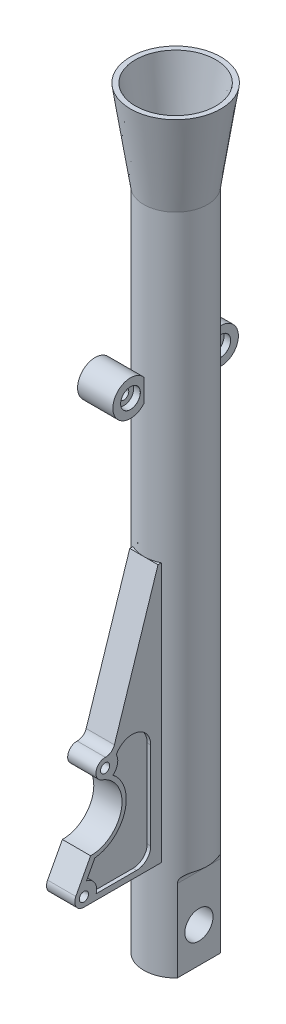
ISO-10303-21;
HEADER;
FILE_DESCRIPTION(('STEP AP214'),'2;1');
FILE_NAME('part.step','',(''),(''),'','','');
FILE_SCHEMA(('AUTOMOTIVE_DESIGN { 1 0 10303 214 1 1 1 1 }'));
ENDSEC;
DATA;
#1=APPLICATION_CONTEXT('core data for automotive mechanical design processes');
#2=APPLICATION_PROTOCOL_DEFINITION('international standard','automotive_design',2000,#1);
#3=PRODUCT_CONTEXT('',#1,'mechanical');
#4=PRODUCT('Part','Part','',(#3));
#5=PRODUCT_RELATED_PRODUCT_CATEGORY('part','',(#4));
#6=PRODUCT_DEFINITION_FORMATION('','',#4);
#7=PRODUCT_DEFINITION_CONTEXT('part definition',#1,'design');
#8=PRODUCT_DEFINITION('design','',#6,#7);
#9=PRODUCT_DEFINITION_SHAPE('','',#8);
#10=(LENGTH_UNIT() NAMED_UNIT(*) SI_UNIT(.MILLI.,.METRE.));
#11=(NAMED_UNIT(*) PLANE_ANGLE_UNIT() SI_UNIT($,.RADIAN.));
#12=(NAMED_UNIT(*) SI_UNIT($,.STERADIAN.) SOLID_ANGLE_UNIT());
#13=UNCERTAINTY_MEASURE_WITH_UNIT(LENGTH_MEASURE(1.E-05),#10,'distance_accuracy_value','');
#14=(GEOMETRIC_REPRESENTATION_CONTEXT(3) GLOBAL_UNCERTAINTY_ASSIGNED_CONTEXT((#13)) GLOBAL_UNIT_ASSIGNED_CONTEXT((#10,
#11,#12)) REPRESENTATION_CONTEXT('',''));
#15=CARTESIAN_POINT('',(0.,0.,0.));
#16=DIRECTION('',(0.,0.,1.));
#17=DIRECTION('',(1.,0.,0.));
#18=AXIS2_PLACEMENT_3D('',#15,#16,#17);
#19=CARTESIAN_POINT('',(-10.,254.,-44.502));
#20=DIRECTION('',(-1.,0.,0.));
#21=DIRECTION('',(0.,-1.,0.));
#22=AXIS2_PLACEMENT_3D('',#19,#20,#21);
#23=PLANE('',#22);
#24=CARTESIAN_POINT('',(-10.,147.942284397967,60.));
#25=DIRECTION('',(-1.,0.,0.));
#26=DIRECTION('',(0.,-1.,0.));
#27=AXIS2_PLACEMENT_3D('',#24,#25,#26);
#28=CIRCLE('',#27,3.25);
#29=CARTESIAN_POINT('',(-10.,144.692284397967,60.));
#30=VERTEX_POINT('',#29);
#31=EDGE_CURVE('E45',#30,#30,#28,.T.);
#32=ORIENTED_EDGE('',*,*,#31,.F.);
#33=EDGE_LOOP('',(#32));
#34=FACE_BOUND('',#33,.T.);
#35=CARTESIAN_POINT('',(-10.,76.5,75.));
#36=DIRECTION('',(-1.,0.,0.));
#37=DIRECTION('',(0.,-1.,0.));
#38=AXIS2_PLACEMENT_3D('',#35,#36,#37);
#39=CIRCLE('',#38,3.25000000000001);
#40=CARTESIAN_POINT('',(-10.,73.25,75.));
#41=VERTEX_POINT('',#40);
#42=EDGE_CURVE('E381',#41,#41,#39,.T.);
#43=ORIENTED_EDGE('',*,*,#42,.F.);
#44=EDGE_LOOP('',(#43));
#45=FACE_BOUND('',#44,.T.);
#46=DIRECTION('',(0.,-0.951056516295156,0.309016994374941));
#47=VECTOR('',#46,1.);
#48=CARTESIAN_POINT('',(-10.,273.69139373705,16.1018783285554));
#49=LINE('',#48,#47);
#50=CARTESIAN_POINT('',(-10.,254.,22.5));
#51=VERTEX_POINT('',#50);
#52=CARTESIAN_POINT('',(-10.,158.926661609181,53.3912002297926));
#53=VERTEX_POINT('',#52);
#54=EDGE_CURVE('E417',#51,#53,#49,.T.);
#55=ORIENTED_EDGE('',*,*,#54,.F.);
#56=DIRECTION('',(0.,0.,1.));
#57=VECTOR('',#56,1.);
#58=CARTESIAN_POINT('',(-10.,254.,-44.502));
#59=LINE('',#58,#57);
#60=CARTESIAN_POINT('',(-10.,254.,20.1556443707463));
#61=VERTEX_POINT('',#60);
#62=EDGE_CURVE('E436',#61,#51,#59,.T.);
#63=ORIENTED_EDGE('',*,*,#62,.F.);
#64=DIRECTION('',(0.,-1.,0.));
#65=VECTOR('',#64,1.);
#66=CARTESIAN_POINT('',(-10.0000000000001,470.,20.1556443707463));
#67=LINE('',#66,#65);
#68=CARTESIAN_POINT('',(-10.,70.,20.1556443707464));
#69=VERTEX_POINT('',#68);
#70=EDGE_CURVE('E425',#61,#69,#67,.T.);
#71=ORIENTED_EDGE('',*,*,#70,.T.);
#72=DIRECTION('',(0.,0.,1.));
#73=VECTOR('',#72,1.);
#74=CARTESIAN_POINT('',(-10.,70.,-44.502));
#75=LINE('',#74,#73);
#76=CARTESIAN_POINT('',(-10.,70.,75.));
#77=VERTEX_POINT('',#76);
#78=EDGE_CURVE('E433',#69,#77,#75,.T.);
#79=ORIENTED_EDGE('',*,*,#78,.T.);
#80=CARTESIAN_POINT('',(-10.,76.5,75.));
#81=DIRECTION('',(-1.,0.,0.));
#82=DIRECTION('',(0.,-1.,0.));
#83=AXIS2_PLACEMENT_3D('',#80,#81,#82);
#84=CIRCLE('',#83,6.49999999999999);
#85=CARTESIAN_POINT('',(-10.,79.5515651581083,80.739159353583));
#86=VERTEX_POINT('',#85);
#87=EDGE_CURVE('E419',#86,#77,#84,.F.);
#88=ORIENTED_EDGE('',*,*,#87,.F.);
#89=DIRECTION('',(0.,-0.882947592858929,0.469471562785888));
#90=VECTOR('',#89,1.);
#91=CARTESIAN_POINT('',(-10.,267.465759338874,-19.1765900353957));
#92=LINE('',#91,#90);
#93=CARTESIAN_POINT('',(-10.,99.2558347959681,70.2622133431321));
#94=VERTEX_POINT('',#93);
#95=EDGE_CURVE('E602',#94,#86,#92,.T.);
#96=ORIENTED_EDGE('',*,*,#95,.F.);
#97=CARTESIAN_POINT('',(-10.,121.254272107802,70.));
#98=DIRECTION('',(-1.,0.,0.));
#99=DIRECTION('',(0.,-1.,0.));
#100=AXIS2_PLACEMENT_3D('',#97,#98,#99);
#101=CIRCLE('',#100,22.);
#102=CARTESIAN_POINT('',(-10.,141.855544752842,62.280701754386));
#103=VERTEX_POINT('',#102);
#104=EDGE_CURVE('E608',#103,#94,#101,.T.);
#105=ORIENTED_EDGE('',*,*,#104,.F.);
#106=CARTESIAN_POINT('',(-10.,147.942284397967,60.));
#107=DIRECTION('',(-1.,0.,0.));
#108=DIRECTION('',(0.,-1.,0.));
#109=AXIS2_PLACEMENT_3D('',#106,#107,#108);
#110=CIRCLE('',#109,6.49999999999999);
#111=CARTESIAN_POINT('',(-10.,154.438778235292,59.7865337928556));
#112=VERTEX_POINT('',#111);
#113=EDGE_CURVE('E50',#112,#103,#110,.F.);
#114=ORIENTED_EDGE('',*,*,#113,.F.);
#115=CARTESIAN_POINT('',(-10.,160.935272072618,59.5730675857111));
#116=DIRECTION('',(-1.,0.,0.));
#117=DIRECTION('',(0.,-1.,0.));
#118=AXIS2_PLACEMENT_3D('',#115,#116,#117);
#119=CIRCLE('',#118,6.50000000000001);
#120=EDGE_CURVE('E12',#53,#112,#119,.T.);
#121=ORIENTED_EDGE('',*,*,#120,.F.);
#122=EDGE_LOOP('',(#55,#63,#71,#79,#88,#96,#105,#114,#121));
#123=FACE_BOUND('',#122,.T.);
#124=DIRECTION('',(0.,1.,0.));
#125=VECTOR('',#124,1.);
#126=CARTESIAN_POINT('',(-9.99999999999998,146.,27.6556443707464));
#127=LINE('',#126,#125);
#128=CARTESIAN_POINT('',(-9.99999999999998,84.0000000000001,27.6556443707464));
#129=VERTEX_POINT('',#128);
#130=CARTESIAN_POINT('',(-10.,146.,27.6556443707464));
#131=VERTEX_POINT('',#130);
#132=EDGE_CURVE('E286',#129,#131,#127,.T.);
#133=ORIENTED_EDGE('',*,*,#132,.T.);
#134=CARTESIAN_POINT('',(-9.99999999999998,146.,40.6556443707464));
#135=DIRECTION('',(1.,0.,0.));
#136=DIRECTION('',(0.,1.,0.));
#137=AXIS2_PLACEMENT_3D('',#134,#135,#136);
#138=CIRCLE('',#137,13.);
#139=CARTESIAN_POINT('',(-9.99999999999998,152.210275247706,52.0763484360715));
#140=VERTEX_POINT('',#139);
#141=EDGE_CURVE('E58',#131,#140,#138,.T.);
#142=ORIENTED_EDGE('',*,*,#141,.T.);
#143=CARTESIAN_POINT('',(-9.99999999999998,147.942284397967,60.));
#144=DIRECTION('',(-1.,0.,0.));
#145=DIRECTION('',(0.,1.,0.));
#146=AXIS2_PLACEMENT_3D('',#143,#144,#145);
#147=CIRCLE('',#146,9.00000000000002);
#148=CARTESIAN_POINT('',(-9.99999999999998,140.843591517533,54.4674997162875));
#149=VERTEX_POINT('',#148);
#150=EDGE_CURVE('E269',#140,#149,#147,.T.);
#151=ORIENTED_EDGE('',*,*,#150,.T.);
#152=CARTESIAN_POINT('',(-9.99999999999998,121.254272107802,70.));
#153=DIRECTION('',(-1.,0.,0.));
#154=DIRECTION('',(0.,1.,0.));
#155=AXIS2_PLACEMENT_3D('',#152,#153,#154);
#156=CIRCLE('',#155,25.);
#157=CARTESIAN_POINT('',(-9.99999999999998,96.4063087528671,67.2470530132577));
#158=VERTEX_POINT('',#157);
#159=EDGE_CURVE('E272',#149,#158,#156,.T.);
#160=ORIENTED_EDGE('',*,*,#159,.T.);
#161=DIRECTION('',(0.,-0.882947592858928,0.469471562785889));
#162=VECTOR('',#161,1.);
#163=CARTESIAN_POINT('',(-9.99999999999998,85.3074744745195,73.1484078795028));
#164=LINE('',#163,#162);
#165=CARTESIAN_POINT('',(-9.99999999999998,85.3074744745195,73.1484078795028));
#166=VERTEX_POINT('',#165);
#167=EDGE_CURVE('E297',#158,#166,#164,.T.);
#168=ORIENTED_EDGE('',*,*,#167,.T.);
#169=CARTESIAN_POINT('',(-9.99999999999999,76.5,75.));
#170=DIRECTION('',(-1.,0.,0.));
#171=DIRECTION('',(0.,1.,0.));
#172=AXIS2_PLACEMENT_3D('',#169,#170,#171);
#173=CIRCLE('',#172,9.);
#174=CARTESIAN_POINT('',(-9.99999999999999,74.,66.3541917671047));
#175=VERTEX_POINT('',#174);
#176=EDGE_CURVE('E294',#166,#175,#173,.T.);
#177=ORIENTED_EDGE('',*,*,#176,.T.);
#178=DIRECTION('',(0.,0.,-1.));
#179=VECTOR('',#178,1.);
#180=CARTESIAN_POINT('',(-9.99999999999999,74.,37.6556443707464));
#181=LINE('',#180,#179);
#182=CARTESIAN_POINT('',(-9.99999999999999,74.,37.6556443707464));
#183=VERTEX_POINT('',#182);
#184=EDGE_CURVE('E291',#175,#183,#181,.T.);
#185=ORIENTED_EDGE('',*,*,#184,.T.);
#186=CARTESIAN_POINT('',(-9.99999999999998,84.,37.6556443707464));
#187=DIRECTION('',(1.,0.,0.));
#188=DIRECTION('',(0.,-1.,0.));
#189=AXIS2_PLACEMENT_3D('',#186,#187,#188);
#190=CIRCLE('',#189,10.);
#191=EDGE_CURVE('E288',#183,#129,#190,.T.);
#192=ORIENTED_EDGE('',*,*,#191,.T.);
#193=EDGE_LOOP('',(#133,#142,#151,#160,#168,#177,#185,#192));
#194=FACE_BOUND('',#193,.T.);
#195=ADVANCED_FACE('F40',(#34,#45,#123,#194),#23,.T.);
#196=CARTESIAN_POINT('',(9.99999999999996,254.,-44.502));
#197=DIRECTION('',(1.,0.,0.));
#198=DIRECTION('',(0.,1.,0.));
#199=AXIS2_PLACEMENT_3D('',#196,#197,#198);
#200=PLANE('',#199);
#201=DIRECTION('',(0.,0.951056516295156,-0.309016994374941));
#202=VECTOR('',#201,1.);
#203=CARTESIAN_POINT('',(9.99999999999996,254.,22.5));
#204=LINE('',#203,#202);
#205=CARTESIAN_POINT('',(9.99999999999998,158.926661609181,53.3912002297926));
#206=VERTEX_POINT('',#205);
#207=CARTESIAN_POINT('',(9.99999999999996,254.,22.5));
#208=VERTEX_POINT('',#207);
#209=EDGE_CURVE('E399',#206,#208,#204,.T.);
#210=ORIENTED_EDGE('',*,*,#209,.F.);
#211=CARTESIAN_POINT('',(9.99999999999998,160.935272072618,59.5730675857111));
#212=DIRECTION('',(1.,0.,0.));
#213=DIRECTION('',(0.,-1.,0.));
#214=AXIS2_PLACEMENT_3D('',#211,#212,#213);
#215=CIRCLE('',#214,6.50000000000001);
#216=CARTESIAN_POINT('',(9.99999999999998,154.438778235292,59.7865337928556));
#217=VERTEX_POINT('',#216);
#218=EDGE_CURVE('E396',#217,#206,#215,.T.);
#219=ORIENTED_EDGE('',*,*,#218,.F.);
#220=CARTESIAN_POINT('',(9.99999999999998,147.942284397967,60.));
#221=DIRECTION('',(-1.,0.,0.));
#222=DIRECTION('',(0.,1.,0.));
#223=AXIS2_PLACEMENT_3D('',#220,#221,#222);
#224=CIRCLE('',#223,6.49999999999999);
#225=CARTESIAN_POINT('',(9.99999999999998,141.855544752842,62.280701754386));
#226=VERTEX_POINT('',#225);
#227=EDGE_CURVE('E393',#226,#217,#224,.T.);
#228=ORIENTED_EDGE('',*,*,#227,.F.);
#229=CARTESIAN_POINT('',(9.99999999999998,121.254272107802,70.));
#230=DIRECTION('',(1.,0.,0.));
#231=DIRECTION('',(0.,-1.,0.));
#232=AXIS2_PLACEMENT_3D('',#229,#230,#231);
#233=CIRCLE('',#232,22.);
#234=CARTESIAN_POINT('',(9.99999999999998,99.2558347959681,70.2622133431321));
#235=VERTEX_POINT('',#234);
#236=EDGE_CURVE('E390',#235,#226,#233,.T.);
#237=ORIENTED_EDGE('',*,*,#236,.F.);
#238=DIRECTION('',(0.,0.882947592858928,-0.469471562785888));
#239=VECTOR('',#238,1.);
#240=CARTESIAN_POINT('',(9.99999999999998,99.2558347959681,70.2622133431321));
#241=LINE('',#240,#239);
#242=CARTESIAN_POINT('',(9.99999999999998,79.5515651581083,80.739159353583));
#243=VERTEX_POINT('',#242);
#244=EDGE_CURVE('E387',#243,#235,#241,.T.);
#245=ORIENTED_EDGE('',*,*,#244,.F.);
#246=CARTESIAN_POINT('',(9.99999999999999,76.5,75.));
#247=DIRECTION('',(-1.,0.,0.));
#248=DIRECTION('',(0.,1.,0.));
#249=AXIS2_PLACEMENT_3D('',#246,#247,#248);
#250=CIRCLE('',#249,6.49999999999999);
#251=CARTESIAN_POINT('',(9.99999999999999,70.,75.));
#252=VERTEX_POINT('',#251);
#253=EDGE_CURVE('E384',#252,#243,#250,.T.);
#254=ORIENTED_EDGE('',*,*,#253,.F.);
#255=DIRECTION('',(0.,0.,1.));
#256=VECTOR('',#255,1.);
#257=CARTESIAN_POINT('',(9.99999999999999,70.,-44.502));
#258=LINE('',#257,#256);
#259=CARTESIAN_POINT('',(9.99999999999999,70.,20.1556443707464));
#260=VERTEX_POINT('',#259);
#261=EDGE_CURVE('E429',#260,#252,#258,.T.);
#262=ORIENTED_EDGE('',*,*,#261,.F.);
#263=DIRECTION('',(0.,-1.,0.));
#264=VECTOR('',#263,1.);
#265=CARTESIAN_POINT('',(9.99999999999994,470.,20.1556443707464));
#266=LINE('',#265,#264);
#267=CARTESIAN_POINT('',(9.99999999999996,254.,20.1556443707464));
#268=VERTEX_POINT('',#267);
#269=EDGE_CURVE('E421',#260,#268,#266,.F.);
#270=ORIENTED_EDGE('',*,*,#269,.T.);
#271=DIRECTION('',(0.,0.,1.));
#272=VECTOR('',#271,1.);
#273=CARTESIAN_POINT('',(9.99999999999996,254.,-44.502));
#274=LINE('',#273,#272);
#275=EDGE_CURVE('E439',#268,#208,#274,.T.);
#276=ORIENTED_EDGE('',*,*,#275,.T.);
#277=EDGE_LOOP('',(#210,#219,#228,#237,#245,#254,#262,#270,#276));
#278=FACE_BOUND('',#277,.T.);
#279=CARTESIAN_POINT('',(9.99999999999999,76.5,75.));
#280=DIRECTION('',(1.,0.,0.));
#281=DIRECTION('',(0.,1.,0.));
#282=AXIS2_PLACEMENT_3D('',#279,#280,#281);
#283=CIRCLE('',#282,3.25000000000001);
#284=CARTESIAN_POINT('',(9.99999999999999,79.75,75.));
#285=VERTEX_POINT('',#284);
#286=EDGE_CURVE('E364',#285,#285,#283,.T.);
#287=ORIENTED_EDGE('',*,*,#286,.F.);
#288=EDGE_LOOP('',(#287));
#289=FACE_BOUND('',#288,.T.);
#290=CARTESIAN_POINT('',(9.99999999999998,147.942284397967,60.));
#291=DIRECTION('',(1.,0.,0.));
#292=DIRECTION('',(0.,1.,0.));
#293=AXIS2_PLACEMENT_3D('',#290,#291,#292);
#294=CIRCLE('',#293,3.25);
#295=CARTESIAN_POINT('',(9.99999999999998,151.192284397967,60.));
#296=VERTEX_POINT('',#295);
#297=EDGE_CURVE('E378',#296,#296,#294,.T.);
#298=ORIENTED_EDGE('',*,*,#297,.F.);
#299=EDGE_LOOP('',(#298));
#300=FACE_BOUND('',#299,.T.);
#301=CARTESIAN_POINT('',(9.99999999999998,146.,40.6556443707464));
#302=DIRECTION('',(1.,0.,0.));
#303=DIRECTION('',(0.,1.,0.));
#304=AXIS2_PLACEMENT_3D('',#301,#302,#303);
#305=CIRCLE('',#304,13.);
#306=CARTESIAN_POINT('',(9.99999999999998,146.,27.6556443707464));
#307=VERTEX_POINT('',#306);
#308=CARTESIAN_POINT('',(9.99999999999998,152.210275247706,52.0763484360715));
#309=VERTEX_POINT('',#308);
#310=EDGE_CURVE('E66',#307,#309,#305,.T.);
#311=ORIENTED_EDGE('',*,*,#310,.F.);
#312=DIRECTION('',(0.,1.,0.));
#313=VECTOR('',#312,1.);
#314=CARTESIAN_POINT('',(9.99999999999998,146.,27.6556443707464));
#315=LINE('',#314,#313);
#316=CARTESIAN_POINT('',(9.99999999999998,84.0000000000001,27.6556443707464));
#317=VERTEX_POINT('',#316);
#318=EDGE_CURVE('E319',#317,#307,#315,.T.);
#319=ORIENTED_EDGE('',*,*,#318,.F.);
#320=CARTESIAN_POINT('',(9.99999999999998,84.,37.6556443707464));
#321=DIRECTION('',(1.,0.,0.));
#322=DIRECTION('',(0.,-1.,0.));
#323=AXIS2_PLACEMENT_3D('',#320,#321,#322);
#324=CIRCLE('',#323,10.);
#325=CARTESIAN_POINT('',(9.99999999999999,74.,37.6556443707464));
#326=VERTEX_POINT('',#325);
#327=EDGE_CURVE('E357',#326,#317,#324,.T.);
#328=ORIENTED_EDGE('',*,*,#327,.F.);
#329=DIRECTION('',(0.,0.,-1.));
#330=VECTOR('',#329,1.);
#331=CARTESIAN_POINT('',(9.99999999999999,74.,37.6556443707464));
#332=LINE('',#331,#330);
#333=CARTESIAN_POINT('',(9.99999999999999,74.,66.3541917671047));
#334=VERTEX_POINT('',#333);
#335=EDGE_CURVE('E354',#334,#326,#332,.T.);
#336=ORIENTED_EDGE('',*,*,#335,.F.);
#337=CARTESIAN_POINT('',(9.99999999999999,76.5,75.));
#338=DIRECTION('',(-1.,0.,0.));
#339=DIRECTION('',(0.,1.,0.));
#340=AXIS2_PLACEMENT_3D('',#337,#338,#339);
#341=CIRCLE('',#340,9.);
#342=CARTESIAN_POINT('',(9.99999999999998,85.3074744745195,73.1484078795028));
#343=VERTEX_POINT('',#342);
#344=EDGE_CURVE('E351',#343,#334,#341,.T.);
#345=ORIENTED_EDGE('',*,*,#344,.F.);
#346=DIRECTION('',(0.,-0.882947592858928,0.469471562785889));
#347=VECTOR('',#346,1.);
#348=CARTESIAN_POINT('',(9.99999999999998,85.3074744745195,73.1484078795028));
#349=LINE('',#348,#347);
#350=CARTESIAN_POINT('',(9.99999999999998,96.4063087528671,67.2470530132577));
#351=VERTEX_POINT('',#350);
#352=EDGE_CURVE('E348',#351,#343,#349,.T.);
#353=ORIENTED_EDGE('',*,*,#352,.F.);
#354=CARTESIAN_POINT('',(9.99999999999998,121.254272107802,70.));
#355=DIRECTION('',(-1.,0.,0.));
#356=DIRECTION('',(0.,1.,0.));
#357=AXIS2_PLACEMENT_3D('',#354,#355,#356);
#358=CIRCLE('',#357,25.);
#359=CARTESIAN_POINT('',(9.99999999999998,140.843591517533,54.4674997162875));
#360=VERTEX_POINT('',#359);
#361=EDGE_CURVE('E345',#360,#351,#358,.T.);
#362=ORIENTED_EDGE('',*,*,#361,.F.);
#363=CARTESIAN_POINT('',(9.99999999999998,147.942284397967,60.));
#364=DIRECTION('',(-1.,0.,0.));
#365=DIRECTION('',(0.,1.,0.));
#366=AXIS2_PLACEMENT_3D('',#363,#364,#365);
#367=CIRCLE('',#366,9.00000000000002);
#368=EDGE_CURVE('E342',#309,#360,#367,.T.);
#369=ORIENTED_EDGE('',*,*,#368,.F.);
#370=EDGE_LOOP('',(#311,#319,#328,#336,#345,#353,#362,#369));
#371=FACE_BOUND('',#370,.T.);
#372=ADVANCED_FACE('F545',(#278,#289,#300,#371),#200,.T.);
#373=CARTESIAN_POINT('',(-10.,70.,-44.502));
#374=DIRECTION('',(0.,-1.,0.));
#375=DIRECTION('',(0.,0.,-1.));
#376=AXIS2_PLACEMENT_3D('',#373,#374,#375);
#377=PLANE('',#376);
#378=ORIENTED_EDGE('',*,*,#261,.T.);
#379=DIRECTION('',(1.,0.,0.));
#380=VECTOR('',#379,1.);
#381=CARTESIAN_POINT('',(-32.0001,70.,75.));
#382=LINE('',#381,#380);
#383=EDGE_CURVE('E401',#77,#252,#382,.T.);
#384=ORIENTED_EDGE('',*,*,#383,.F.);
#385=ORIENTED_EDGE('',*,*,#78,.F.);
#386=CARTESIAN_POINT('',(0.,70.,0.));
#387=DIRECTION('',(0.,-1.,0.));
#388=DIRECTION('',(0.,0.,-1.));
#389=AXIS2_PLACEMENT_3D('',#386,#387,#388);
#390=CIRCLE('',#389,22.5);
#391=EDGE_CURVE('E427',#69,#260,#390,.F.);
#392=ORIENTED_EDGE('',*,*,#391,.T.);
#393=EDGE_LOOP('',(#378,#384,#385,#392));
#394=FACE_BOUND('',#393,.T.);
#395=ADVANCED_FACE('F551',(#394),#377,.T.);
#396=CARTESIAN_POINT('',(-10.,254.,-44.502));
#397=DIRECTION('',(0.,1.,0.));
#398=DIRECTION('',(0.,0.,1.));
#399=AXIS2_PLACEMENT_3D('',#396,#397,#398);
#400=PLANE('',#399);
#401=DIRECTION('',(1.,0.,0.));
#402=VECTOR('',#401,1.);
#403=CARTESIAN_POINT('',(-32.0001,254.,22.5));
#404=LINE('',#403,#402);
#405=CARTESIAN_POINT('',(0.,254.,22.5));
#406=VERTEX_POINT('',#405);
#407=EDGE_CURVE('E402',#406,#208,#404,.T.);
#408=ORIENTED_EDGE('',*,*,#407,.T.);
#409=ORIENTED_EDGE('',*,*,#275,.F.);
#410=CARTESIAN_POINT('',(0.,254.,0.));
#411=DIRECTION('',(0.,1.,0.));
#412=DIRECTION('',(0.,0.,1.));
#413=AXIS2_PLACEMENT_3D('',#410,#411,#412);
#414=CIRCLE('',#413,22.5);
#415=EDGE_CURVE('E428',#268,#406,#414,.F.);
#416=ORIENTED_EDGE('',*,*,#415,.T.);
#417=EDGE_LOOP('',(#408,#409,#416));
#418=FACE_BOUND('',#417,.T.);
#419=ADVANCED_FACE('F541',(#418),#400,.T.);
#420=CARTESIAN_POINT('',(0.,470.,0.));
#421=DIRECTION('',(0.,-1.,0.));
#422=DIRECTION('',(0.,0.,-1.));
#423=AXIS2_PLACEMENT_3D('',#420,#421,#422);
#424=CYLINDRICAL_SURFACE('',#423,22.5);
#425=ORIENTED_EDGE('',*,*,#269,.F.);
#426=ORIENTED_EDGE('',*,*,#391,.F.);
#427=ORIENTED_EDGE('',*,*,#70,.F.);
#428=EDGE_CURVE('E424',#406,#61,#414,.F.);
#429=ORIENTED_EDGE('',*,*,#428,.F.);
#430=ORIENTED_EDGE('',*,*,#415,.F.);
#431=EDGE_LOOP('',(#425,#426,#427,#429,#430));
#432=FACE_BOUND('',#431,.T.);
#433=DIRECTION('',(0.,-1.,0.));
#434=VECTOR('',#433,1.);
#435=CARTESIAN_POINT('',(-16.4999999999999,470.,-15.2970585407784));
#436=LINE('',#435,#434);
#437=CARTESIAN_POINT('',(-16.5,58.,-15.2970585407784));
#438=VERTEX_POINT('',#437);
#439=CARTESIAN_POINT('',(-16.5,0.,-15.2970585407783));
#440=VERTEX_POINT('',#439);
#441=EDGE_CURVE('E490',#438,#440,#436,.T.);
#442=ORIENTED_EDGE('',*,*,#441,.F.);
#443=CARTESIAN_POINT('',(-16.5,58.,15.2970585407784));
#444=CARTESIAN_POINT('',(-16.4999684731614,58.126715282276,15.2970784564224));
#445=CARTESIAN_POINT('',(-16.5040128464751,58.2534159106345,15.2927297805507));
#446=CARTESIAN_POINT('',(-16.5200193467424,58.5056593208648,15.2754448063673));
#447=CARTESIAN_POINT('',(-16.5319771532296,58.6312026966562,15.262513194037));
#448=CARTESIAN_POINT('',(-16.5634679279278,58.8792848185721,15.2283299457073));
#449=CARTESIAN_POINT('',(-16.5829480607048,59.0018383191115,15.207136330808));
#450=CARTESIAN_POINT('',(-16.6290648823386,59.2439045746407,15.1566940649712));
#451=CARTESIAN_POINT('',(-16.6557021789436,59.3634170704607,15.1274447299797));
#452=CARTESIAN_POINT('',(-16.7155394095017,59.5983354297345,15.0612987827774));
#453=CARTESIAN_POINT('',(-16.7487257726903,59.7137492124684,15.0244179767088));
#454=CARTESIAN_POINT('',(-16.8210718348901,59.9400807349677,14.9433762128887));
#455=CARTESIAN_POINT('',(-16.8602338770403,60.0509966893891,14.8992123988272));
#456=CARTESIAN_POINT('',(-16.9857562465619,60.3763619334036,14.7563599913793));
#457=CARTESIAN_POINT('',(-17.0801192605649,60.5833011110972,14.6473468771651));
#458=CARTESIAN_POINT('',(-17.3171485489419,61.0369418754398,14.3669668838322));
#459=CARTESIAN_POINT('',(-17.4656011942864,61.2751165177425,14.1868146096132));
#460=CARTESIAN_POINT('',(-17.7776933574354,61.7110626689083,13.7937177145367));
#461=CARTESIAN_POINT('',(-17.9413578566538,61.908765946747,13.5807187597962));
#462=CARTESIAN_POINT('',(-18.2285031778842,62.2173119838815,13.1914100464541));
#463=CARTESIAN_POINT('',(-18.3506936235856,62.3371059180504,13.0210602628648));
#464=CARTESIAN_POINT('',(-18.5954043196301,62.5586605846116,12.6691294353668));
#465=CARTESIAN_POINT('',(-18.717924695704,62.6604130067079,12.4875432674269));
#466=CARTESIAN_POINT('',(-18.9612648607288,62.8477800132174,12.1148686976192));
#467=CARTESIAN_POINT('',(-19.0820824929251,62.933375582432,11.9237694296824));
#468=CARTESIAN_POINT('',(-19.3203520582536,63.0902031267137,11.5337031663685));
#469=CARTESIAN_POINT('',(-19.4378027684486,63.1614299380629,11.3347333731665));
#470=CARTESIAN_POINT('',(-19.7455993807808,63.3350072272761,10.7941001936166));
#471=CARTESIAN_POINT('',(-19.9318497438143,63.4260757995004,10.4464603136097));
#472=CARTESIAN_POINT('',(-20.2879348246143,63.5807193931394,9.73692220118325));
#473=CARTESIAN_POINT('',(-20.4577583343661,63.6442757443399,9.37501446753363));
#474=CARTESIAN_POINT('',(-20.7791834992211,63.7504332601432,8.63927511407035));
#475=CARTESIAN_POINT('',(-20.9307421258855,63.7929856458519,8.26541786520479));
#476=CARTESIAN_POINT('',(-21.2139035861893,63.8623544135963,7.50889155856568));
#477=CARTESIAN_POINT('',(-21.3455082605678,63.8891722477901,7.12622331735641));
#478=CARTESIAN_POINT('',(-21.5588897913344,63.9264678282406,6.44661916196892));
#479=CARTESIAN_POINT('',(-21.645042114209,63.9393232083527,6.15116956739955));
#480=CARTESIAN_POINT('',(-21.8051997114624,63.9601830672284,5.55679717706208));
#481=CARTESIAN_POINT('',(-21.8792039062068,63.968187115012,5.25787407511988));
#482=CARTESIAN_POINT('',(-22.0149184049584,63.9807473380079,4.65706548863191));
#483=CARTESIAN_POINT('',(-22.0766240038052,63.9853021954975,4.35517891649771));
#484=CARTESIAN_POINT('',(-22.1875881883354,63.9921189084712,3.74911124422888));
#485=CARTESIAN_POINT('',(-22.2368471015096,63.9943808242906,3.44493020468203));
#486=CARTESIAN_POINT('',(-22.3228453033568,63.9975385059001,2.83470456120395));
#487=CARTESIAN_POINT('',(-22.3595808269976,63.998433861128,2.52865942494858));
#488=CARTESIAN_POINT('',(-22.4204491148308,63.9995498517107,1.91531609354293));
#489=CARTESIAN_POINT('',(-22.4445818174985,63.9997704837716,1.60801789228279));
#490=CARTESIAN_POINT('',(-22.4801997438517,63.999993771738,0.992751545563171));
#491=CARTESIAN_POINT('',(-22.4916875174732,63.999996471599,0.684783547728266));
#492=CARTESIAN_POINT('',(-22.5020049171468,64.0000018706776,0.0686360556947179));
#493=CARTESIAN_POINT('',(-22.5008345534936,64.0000045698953,-0.239543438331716));
#494=CARTESIAN_POINT('',(-22.485754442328,63.9999879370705,-0.859011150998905));
#495=CARTESIAN_POINT('',(-22.4717035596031,63.9999683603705,-1.17029594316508));
#496=CARTESIAN_POINT('',(-22.4306873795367,63.9996346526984,-1.79201530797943));
#497=CARTESIAN_POINT('',(-22.4037219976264,63.9993205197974,-2.10244987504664));
#498=CARTESIAN_POINT('',(-22.336913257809,63.9978762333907,-2.72202490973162));
#499=CARTESIAN_POINT('',(-22.2970659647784,63.9967458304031,-3.03116495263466));
#500=CARTESIAN_POINT('',(-22.2045663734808,63.9929009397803,-3.64751150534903));
#501=CARTESIAN_POINT('',(-22.1519142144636,63.990186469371,-3.95471803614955));
#502=CARTESIAN_POINT('',(-22.0339994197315,63.9821676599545,-4.56614087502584));
#503=CARTESIAN_POINT('',(-21.9687578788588,63.9768676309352,-4.87036130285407));
#504=CARTESIAN_POINT('',(-21.8257347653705,63.9624268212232,-5.47576908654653));
#505=CARTESIAN_POINT('',(-21.7479525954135,63.9532858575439,-5.77695629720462));
#506=CARTESIAN_POINT('',(-21.5800816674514,63.9296653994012,-6.37546926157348));
#507=CARTESIAN_POINT('',(-21.4900008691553,63.9151893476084,-6.6727973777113));
#508=CARTESIAN_POINT('',(-21.2977575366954,63.8791307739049,-7.26304599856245));
#509=CARTESIAN_POINT('',(-21.1955969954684,63.8575494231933,-7.55596722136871));
#510=CARTESIAN_POINT('',(-20.980784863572,63.8055197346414,-8.1332910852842));
#511=CARTESIAN_POINT('',(-20.8682677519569,63.7751764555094,-8.41775299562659));
#512=CARTESIAN_POINT('',(-20.6322780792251,63.7032302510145,-8.98065772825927));
#513=CARTESIAN_POINT('',(-20.5088062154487,63.6616280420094,-9.2591009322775));
#514=CARTESIAN_POINT('',(-20.251734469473,63.564546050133,-9.80862895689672));
#515=CARTESIAN_POINT('',(-20.1181408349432,63.5090747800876,-10.0797181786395));
#516=CARTESIAN_POINT('',(-19.8418914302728,63.3812294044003,-10.6131748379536));
#517=CARTESIAN_POINT('',(-19.6992375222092,63.3088587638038,-10.8755440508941));
#518=CARTESIAN_POINT('',(-19.4387939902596,63.1619915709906,-11.3329837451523));
#519=CARTESIAN_POINT('',(-19.3224473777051,63.0914732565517,-11.5301502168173));
#520=CARTESIAN_POINT('',(-19.0863867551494,62.9363147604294,-11.9168423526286));
#521=CARTESIAN_POINT('',(-18.9666724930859,62.8516735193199,-12.1063674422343));
#522=CARTESIAN_POINT('',(-18.7255687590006,62.6665543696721,-12.4760439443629));
#523=CARTESIAN_POINT('',(-18.6041818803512,62.5660989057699,-12.6562081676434));
#524=CARTESIAN_POINT('',(-18.3616700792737,62.3475123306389,-13.0055491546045));
#525=CARTESIAN_POINT('',(-18.2405450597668,62.2293896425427,-13.1747310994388));
#526=CARTESIAN_POINT('',(-17.9604425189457,61.9303226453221,-13.5552715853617));
#527=CARTESIAN_POINT('',(-17.8025442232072,61.7416532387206,-13.7614994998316));
#528=CARTESIAN_POINT('',(-17.5002057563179,61.3268220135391,-14.1439810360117));
#529=CARTESIAN_POINT('',(-17.3557497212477,61.100705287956,-14.3202701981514));
#530=CARTESIAN_POINT('',(-17.1140724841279,60.6541030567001,-14.6077887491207));
#531=CARTESIAN_POINT('',(-17.0130125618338,60.439629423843,-14.7250078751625));
#532=CARTESIAN_POINT('',(-16.8786530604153,60.1012454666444,-14.878363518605));
#533=CARTESIAN_POINT('',(-16.8367481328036,59.9857085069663,-14.9257258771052));
#534=CARTESIAN_POINT('',(-16.7594204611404,59.7496133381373,-15.0125014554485));
#535=CARTESIAN_POINT('',(-16.7239947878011,59.6290574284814,-15.0519182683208));
#536=CARTESIAN_POINT('',(-16.6612069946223,59.3869787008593,-15.1213862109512));
#537=CARTESIAN_POINT('',(-16.6336527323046,59.2655701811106,-15.1516617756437));
#538=CARTESIAN_POINT('',(-16.5859312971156,59.0195555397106,-15.2038852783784));
#539=CARTESIAN_POINT('',(-16.5657632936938,58.8949497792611,-15.2258341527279));
#540=CARTESIAN_POINT('',(-16.533144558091,58.6425826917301,-15.2612499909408));
#541=CARTESIAN_POINT('',(-16.5207517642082,58.5148048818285,-15.2746532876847));
#542=CARTESIAN_POINT('',(-16.5041601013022,58.2580238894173,-15.292570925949));
#543=CARTESIAN_POINT('',(-16.4999661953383,58.1290200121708,-15.2970798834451));
#544=CARTESIAN_POINT('',(-16.5,58.,-15.2970585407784));
#545=B_SPLINE_CURVE_WITH_KNOTS('',3,(#443,#444,#445,#446,#447,#448,#449,#450,#451,#452,#453,
#454,#455,#456,#457,#458,#459,#460,#461,#462,#463,#464,#465,#466,#467,#468,#469,#470,#471,#472,
#473,#474,#475,#476,#477,#478,#479,#480,#481,#482,#483,#484,#485,#486,#487,#488,#489,#490,#491,
#492,#493,#494,#495,#496,#497,#498,#499,#500,#501,#502,#503,#504,#505,#506,#507,#508,#509,#510,
#511,#512,#513,#514,#515,#516,#517,#518,#519,#520,#521,#522,#523,#524,#525,#526,#527,#528,#529,
#530,#531,#532,#533,#534,#535,#536,#537,#538,#539,#540,#541,#542,#543,#544),.UNSPECIFIED.,.F.,
.F.,(4,2,2,2,2,2,2,2,2,2,2,2,2,2,2,2,2,2,2,2,2,2,2,2,2,2,2,2,2,2,2,2,2,2,2,2,2,2,2,2,2,2,2,2,2,
2,2,2,2,2,4),(0.,0.379983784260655,0.759760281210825,1.13691644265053,1.51410464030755,
1.89051929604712,2.26708192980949,3.02061261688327,4.01576303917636,5.01257762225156,
5.73599486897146,6.45974447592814,7.184340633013,7.90919672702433,9.12151631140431,
10.3346573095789,11.5506025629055,12.7664355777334,13.6902158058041,14.6140780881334,
15.5382931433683,16.4624838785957,17.3869522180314,18.3114250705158,19.2357114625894,
20.1599971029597,21.0945330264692,22.0290750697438,22.9639028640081,23.8987204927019,
24.8319851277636,25.7652942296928,26.6980021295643,27.6305563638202,28.5523628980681,
29.4741107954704,30.3952943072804,31.3162891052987,32.0344537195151,32.7526722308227,
33.4698804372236,34.1867477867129,35.1464940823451,36.1050929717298,36.8949943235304,
37.2897117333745,37.6842502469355,38.068120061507,38.4519466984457,38.8386005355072,
39.2254883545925),.UNSPECIFIED.);
#546=CARTESIAN_POINT('',(-16.5,58.,15.2970585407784));
#547=VERTEX_POINT('',#546);
#548=EDGE_CURVE('E1171',#547,#438,#545,.T.);
#549=ORIENTED_EDGE('',*,*,#548,.F.);
#550=DIRECTION('',(0.,-1.,0.));
#551=VECTOR('',#550,1.);
#552=CARTESIAN_POINT('',(-16.4999999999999,470.,15.2970585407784));
#553=LINE('',#552,#551);
#554=CARTESIAN_POINT('',(-16.5,0.,15.2970585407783));
#555=VERTEX_POINT('',#554);
#556=EDGE_CURVE('E488',#555,#547,#553,.F.);
#557=ORIENTED_EDGE('',*,*,#556,.F.);
#558=CARTESIAN_POINT('',(0.,0.,0.));
#559=DIRECTION('',(0.,1.,0.));
#560=DIRECTION('',(0.,0.,1.));
#561=AXIS2_PLACEMENT_3D('',#558,#559,#560);
#562=CIRCLE('',#561,22.5);
#563=CARTESIAN_POINT('',(16.5,0.,15.2970585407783));
#564=VERTEX_POINT('',#563);
#565=EDGE_CURVE('E1217',#555,#564,#562,.T.);
#566=ORIENTED_EDGE('',*,*,#565,.T.);
#567=DIRECTION('',(0.,-1.,0.));
#568=VECTOR('',#567,1.);
#569=CARTESIAN_POINT('',(16.4999999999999,470.,15.2970585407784));
#570=LINE('',#569,#568);
#571=CARTESIAN_POINT('',(16.5,58.,15.2970585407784));
#572=VERTEX_POINT('',#571);
#573=EDGE_CURVE('E495',#564,#572,#570,.F.);
#574=ORIENTED_EDGE('',*,*,#573,.T.);
#575=CARTESIAN_POINT('',(16.5,58.,15.2970585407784));
#576=CARTESIAN_POINT('',(16.4999684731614,58.126715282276,15.2970784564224));
#577=CARTESIAN_POINT('',(16.5040128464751,58.2534159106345,15.2927297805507));
#578=CARTESIAN_POINT('',(16.5200193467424,58.5056593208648,15.2754448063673));
#579=CARTESIAN_POINT('',(16.5319771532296,58.6312026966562,15.262513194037));
#580=CARTESIAN_POINT('',(16.5634679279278,58.8792848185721,15.2283299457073));
#581=CARTESIAN_POINT('',(16.5829480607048,59.0018383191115,15.207136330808));
#582=CARTESIAN_POINT('',(16.6290648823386,59.2439045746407,15.1566940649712));
#583=CARTESIAN_POINT('',(16.6557021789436,59.3634170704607,15.1274447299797));
#584=CARTESIAN_POINT('',(16.7155394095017,59.5983354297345,15.0612987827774));
#585=CARTESIAN_POINT('',(16.7487257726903,59.7137492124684,15.0244179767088));
#586=CARTESIAN_POINT('',(16.8210718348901,59.9400807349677,14.9433762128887));
#587=CARTESIAN_POINT('',(16.8602338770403,60.0509966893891,14.8992123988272));
#588=CARTESIAN_POINT('',(16.9857562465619,60.3763619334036,14.7563599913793));
#589=CARTESIAN_POINT('',(17.0801192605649,60.5833011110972,14.6473468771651));
#590=CARTESIAN_POINT('',(17.3171485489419,61.0369418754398,14.3669668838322));
#591=CARTESIAN_POINT('',(17.4656011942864,61.2751165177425,14.1868146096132));
#592=CARTESIAN_POINT('',(17.7776933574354,61.7110626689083,13.7937177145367));
#593=CARTESIAN_POINT('',(17.9413578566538,61.908765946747,13.5807187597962));
#594=CARTESIAN_POINT('',(18.2285031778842,62.2173119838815,13.1914100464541));
#595=CARTESIAN_POINT('',(18.3506936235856,62.3371059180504,13.0210602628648));
#596=CARTESIAN_POINT('',(18.5954043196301,62.5586605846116,12.6691294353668));
#597=CARTESIAN_POINT('',(18.717924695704,62.6604130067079,12.4875432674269));
#598=CARTESIAN_POINT('',(18.9612648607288,62.8477800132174,12.1148686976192));
#599=CARTESIAN_POINT('',(19.0820824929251,62.933375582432,11.9237694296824));
#600=CARTESIAN_POINT('',(19.3203520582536,63.0902031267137,11.5337031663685));
#601=CARTESIAN_POINT('',(19.4378027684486,63.1614299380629,11.3347333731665));
#602=CARTESIAN_POINT('',(19.7455993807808,63.3350072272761,10.7941001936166));
#603=CARTESIAN_POINT('',(19.9318497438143,63.4260757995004,10.4464603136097));
#604=CARTESIAN_POINT('',(20.2879348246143,63.5807193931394,9.73692220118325));
#605=CARTESIAN_POINT('',(20.4577583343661,63.6442757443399,9.37501446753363));
#606=CARTESIAN_POINT('',(20.7791834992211,63.7504332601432,8.63927511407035));
#607=CARTESIAN_POINT('',(20.9307421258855,63.7929856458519,8.26541786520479));
#608=CARTESIAN_POINT('',(21.2139035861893,63.8623544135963,7.50889155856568));
#609=CARTESIAN_POINT('',(21.3455082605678,63.8891722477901,7.12622331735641));
#610=CARTESIAN_POINT('',(21.5588897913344,63.9264678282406,6.44661916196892));
#611=CARTESIAN_POINT('',(21.645042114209,63.9393232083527,6.15116956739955));
#612=CARTESIAN_POINT('',(21.8051997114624,63.9601830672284,5.55679717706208));
#613=CARTESIAN_POINT('',(21.8792039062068,63.968187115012,5.25787407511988));
#614=CARTESIAN_POINT('',(22.0149184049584,63.9807473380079,4.65706548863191));
#615=CARTESIAN_POINT('',(22.0766240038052,63.9853021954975,4.35517891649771));
#616=CARTESIAN_POINT('',(22.1875881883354,63.9921189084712,3.74911124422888));
#617=CARTESIAN_POINT('',(22.2368471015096,63.9943808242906,3.44493020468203));
#618=CARTESIAN_POINT('',(22.3228453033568,63.9975385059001,2.83470456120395));
#619=CARTESIAN_POINT('',(22.3595808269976,63.998433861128,2.52865942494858));
#620=CARTESIAN_POINT('',(22.4204491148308,63.9995498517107,1.91531609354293));
#621=CARTESIAN_POINT('',(22.4445818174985,63.9997704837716,1.60801789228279));
#622=CARTESIAN_POINT('',(22.4801997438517,63.999993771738,0.992751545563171));
#623=CARTESIAN_POINT('',(22.4916875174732,63.999996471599,0.684783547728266));
#624=CARTESIAN_POINT('',(22.5020049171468,64.0000018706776,0.0686360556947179));
#625=CARTESIAN_POINT('',(22.5008345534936,64.0000045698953,-0.239543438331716));
#626=CARTESIAN_POINT('',(22.485754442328,63.9999879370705,-0.859011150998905));
#627=CARTESIAN_POINT('',(22.4717035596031,63.9999683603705,-1.17029594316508));
#628=CARTESIAN_POINT('',(22.4306873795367,63.9996346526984,-1.79201530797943));
#629=CARTESIAN_POINT('',(22.4037219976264,63.9993205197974,-2.10244987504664));
#630=CARTESIAN_POINT('',(22.336913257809,63.9978762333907,-2.72202490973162));
#631=CARTESIAN_POINT('',(22.2970659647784,63.9967458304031,-3.03116495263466));
#632=CARTESIAN_POINT('',(22.2045663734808,63.9929009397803,-3.64751150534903));
#633=CARTESIAN_POINT('',(22.1519142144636,63.990186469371,-3.95471803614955));
#634=CARTESIAN_POINT('',(22.0339994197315,63.9821676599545,-4.56614087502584));
#635=CARTESIAN_POINT('',(21.9687578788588,63.9768676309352,-4.87036130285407));
#636=CARTESIAN_POINT('',(21.8257347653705,63.9624268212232,-5.47576908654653));
#637=CARTESIAN_POINT('',(21.7479525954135,63.9532858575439,-5.77695629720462));
#638=CARTESIAN_POINT('',(21.5800816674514,63.9296653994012,-6.37546926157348));
#639=CARTESIAN_POINT('',(21.4900008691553,63.9151893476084,-6.6727973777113));
#640=CARTESIAN_POINT('',(21.2977575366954,63.8791307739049,-7.26304599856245));
#641=CARTESIAN_POINT('',(21.1955969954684,63.8575494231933,-7.55596722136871));
#642=CARTESIAN_POINT('',(20.980784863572,63.8055197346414,-8.1332910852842));
#643=CARTESIAN_POINT('',(20.8682677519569,63.7751764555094,-8.41775299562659));
#644=CARTESIAN_POINT('',(20.6322780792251,63.7032302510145,-8.98065772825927));
#645=CARTESIAN_POINT('',(20.5088062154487,63.6616280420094,-9.2591009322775));
#646=CARTESIAN_POINT('',(20.251734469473,63.564546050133,-9.80862895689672));
#647=CARTESIAN_POINT('',(20.1181408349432,63.5090747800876,-10.0797181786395));
#648=CARTESIAN_POINT('',(19.8418914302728,63.3812294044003,-10.6131748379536));
#649=CARTESIAN_POINT('',(19.6992375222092,63.3088587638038,-10.8755440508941));
#650=CARTESIAN_POINT('',(19.4387939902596,63.1619915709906,-11.3329837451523));
#651=CARTESIAN_POINT('',(19.3224473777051,63.0914732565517,-11.5301502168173));
#652=CARTESIAN_POINT('',(19.0863867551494,62.9363147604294,-11.9168423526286));
#653=CARTESIAN_POINT('',(18.9666724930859,62.8516735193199,-12.1063674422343));
#654=CARTESIAN_POINT('',(18.7255687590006,62.6665543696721,-12.4760439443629));
#655=CARTESIAN_POINT('',(18.6041818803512,62.5660989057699,-12.6562081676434));
#656=CARTESIAN_POINT('',(18.3616700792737,62.3475123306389,-13.0055491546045));
#657=CARTESIAN_POINT('',(18.2405450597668,62.2293896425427,-13.1747310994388));
#658=CARTESIAN_POINT('',(17.9604425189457,61.9303226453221,-13.5552715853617));
#659=CARTESIAN_POINT('',(17.8025442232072,61.7416532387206,-13.7614994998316));
#660=CARTESIAN_POINT('',(17.5002057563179,61.3268220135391,-14.1439810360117));
#661=CARTESIAN_POINT('',(17.3557497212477,61.100705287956,-14.3202701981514));
#662=CARTESIAN_POINT('',(17.1140724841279,60.6541030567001,-14.6077887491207));
#663=CARTESIAN_POINT('',(17.0130125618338,60.439629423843,-14.7250078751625));
#664=CARTESIAN_POINT('',(16.8786530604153,60.1012454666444,-14.878363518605));
#665=CARTESIAN_POINT('',(16.8367481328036,59.9857085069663,-14.9257258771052));
#666=CARTESIAN_POINT('',(16.7594204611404,59.7496133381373,-15.0125014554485));
#667=CARTESIAN_POINT('',(16.7239947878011,59.6290574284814,-15.0519182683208));
#668=CARTESIAN_POINT('',(16.6612069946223,59.3869787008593,-15.1213862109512));
#669=CARTESIAN_POINT('',(16.6336527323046,59.2655701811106,-15.1516617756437));
#670=CARTESIAN_POINT('',(16.5859312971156,59.0195555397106,-15.2038852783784));
#671=CARTESIAN_POINT('',(16.5657632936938,58.8949497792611,-15.2258341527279));
#672=CARTESIAN_POINT('',(16.533144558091,58.6425826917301,-15.2612499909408));
#673=CARTESIAN_POINT('',(16.5207517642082,58.5148048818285,-15.2746532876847));
#674=CARTESIAN_POINT('',(16.5041601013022,58.2580238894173,-15.292570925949));
#675=CARTESIAN_POINT('',(16.4999661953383,58.1290200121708,-15.2970798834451));
#676=CARTESIAN_POINT('',(16.5,58.,-15.2970585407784));
#677=B_SPLINE_CURVE_WITH_KNOTS('',3,(#575,#576,#577,#578,#579,#580,#581,#582,#583,#584,#585,
#586,#587,#588,#589,#590,#591,#592,#593,#594,#595,#596,#597,#598,#599,#600,#601,#602,#603,#604,
#605,#606,#607,#608,#609,#610,#611,#612,#613,#614,#615,#616,#617,#618,#619,#620,#621,#622,#623,
#624,#625,#626,#627,#628,#629,#630,#631,#632,#633,#634,#635,#636,#637,#638,#639,#640,#641,#642,
#643,#644,#645,#646,#647,#648,#649,#650,#651,#652,#653,#654,#655,#656,#657,#658,#659,#660,#661,
#662,#663,#664,#665,#666,#667,#668,#669,#670,#671,#672,#673,#674,#675,#676),.UNSPECIFIED.,.F.,
.F.,(4,2,2,2,2,2,2,2,2,2,2,2,2,2,2,2,2,2,2,2,2,2,2,2,2,2,2,2,2,2,2,2,2,2,2,2,2,2,2,2,2,2,2,2,2,
2,2,2,2,2,4),(0.,0.379983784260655,0.759760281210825,1.13691644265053,1.51410464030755,
1.89051929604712,2.26708192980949,3.02061261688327,4.01576303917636,5.01257762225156,
5.73599486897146,6.45974447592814,7.184340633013,7.90919672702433,9.12151631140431,
10.3346573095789,11.5506025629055,12.7664355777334,13.6902158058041,14.6140780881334,
15.5382931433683,16.4624838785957,17.3869522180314,18.3114250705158,19.2357114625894,
20.1599971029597,21.0945330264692,22.0290750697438,22.9639028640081,23.8987204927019,
24.8319851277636,25.7652942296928,26.6980021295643,27.6305563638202,28.5523628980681,
29.4741107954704,30.3952943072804,31.3162891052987,32.0344537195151,32.7526722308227,
33.4698804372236,34.1867477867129,35.1464940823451,36.1050929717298,36.8949943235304,
37.2897117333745,37.6842502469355,38.068120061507,38.4519466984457,38.8386005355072,
39.2254883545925),.UNSPECIFIED.);
#678=CARTESIAN_POINT('',(16.5,58.,-15.2970585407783));
#679=VERTEX_POINT('',#678);
#680=EDGE_CURVE('E1159',#572,#679,#677,.T.);
#681=ORIENTED_EDGE('',*,*,#680,.T.);
#682=DIRECTION('',(0.,-1.,0.));
#683=VECTOR('',#682,1.);
#684=CARTESIAN_POINT('',(16.4999999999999,470.,-15.2970585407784));
#685=LINE('',#684,#683);
#686=CARTESIAN_POINT('',(16.5,0.,-15.2970585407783));
#687=VERTEX_POINT('',#686);
#688=EDGE_CURVE('E498',#679,#687,#685,.T.);
#689=ORIENTED_EDGE('',*,*,#688,.T.);
#690=EDGE_CURVE('E1216',#687,#440,#562,.T.);
#691=ORIENTED_EDGE('',*,*,#690,.T.);
#692=EDGE_LOOP('',(#442,#549,#557,#566,#574,#681,#689,#691));
#693=FACE_BOUND('',#692,.T.);
#694=CARTESIAN_POINT('',(0.,470.,0.));
#695=DIRECTION('',(0.,1.,0.));
#696=DIRECTION('',(0.,0.,1.));
#697=AXIS2_PLACEMENT_3D('',#694,#695,#696);
#698=CIRCLE('',#697,22.5);
#699=CARTESIAN_POINT('',(0.,470.,22.5));
#700=VERTEX_POINT('',#699);
#701=EDGE_CURVE('E1219',#700,#700,#698,.T.);
#702=ORIENTED_EDGE('',*,*,#701,.F.);
#703=EDGE_LOOP('',(#702));
#704=FACE_BOUND('',#703,.T.);
#705=DIRECTION('',(0.,-1.,0.));
#706=VECTOR('',#705,1.);
#707=CARTESIAN_POINT('',(0.,470.,22.5));
#708=LINE('',#707,#706);
#709=CARTESIAN_POINT('',(0.,364.124038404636,22.5));
#710=VERTEX_POINT('',#709);
#711=CARTESIAN_POINT('',(0.,347.875961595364,22.5));
#712=VERTEX_POINT('',#711);
#713=EDGE_CURVE('E1177',#710,#712,#708,.T.);
#714=ORIENTED_EDGE('',*,*,#713,.T.);
#715=CARTESIAN_POINT('',(0.,347.875961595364,22.5));
#716=CARTESIAN_POINT('',(-0.189064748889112,347.875967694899,22.5000014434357));
#717=CARTESIAN_POINT('',(-0.378109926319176,347.878747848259,22.4976163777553));
#718=CARTESIAN_POINT('',(-0.755917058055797,347.889902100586,22.4880922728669));
#719=CARTESIAN_POINT('',(-0.944679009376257,347.898276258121,22.4809531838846));
#720=CARTESIAN_POINT('',(-1.51040290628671,347.931872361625,22.452421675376));
#721=CARTESIAN_POINT('',(-1.88656661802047,347.96556804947,22.4239150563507));
#722=CARTESIAN_POINT('',(-2.6370930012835,348.056761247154,22.3481355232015));
#723=CARTESIAN_POINT('',(-3.01141834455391,348.114443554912,22.3007170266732));
#724=CARTESIAN_POINT('',(-3.75248730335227,348.255091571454,22.1880408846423));
#725=CARTESIAN_POINT('',(-4.11923370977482,348.338047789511,22.1227899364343));
#726=CARTESIAN_POINT('',(-4.7756767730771,348.513505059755,21.9893979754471));
#727=CARTESIAN_POINT('',(-5.06715138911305,348.601453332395,21.9239897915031));
#728=CARTESIAN_POINT('',(-5.64104995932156,348.796859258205,21.783382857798));
#729=CARTESIAN_POINT('',(-5.92347562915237,348.904313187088,21.7081859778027));
#730=CARTESIAN_POINT('',(-6.47624710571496,349.139836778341,21.5497251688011));
#731=CARTESIAN_POINT('',(-6.74662581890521,349.267845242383,21.4664854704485));
#732=CARTESIAN_POINT('',(-7.27355148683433,349.546144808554,21.2937136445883));
#733=CARTESIAN_POINT('',(-7.53010244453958,349.696429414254,21.2041833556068));
#734=CARTESIAN_POINT('',(-7.96650372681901,349.981440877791,21.0434109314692));
#735=CARTESIAN_POINT('',(-8.14992272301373,350.111169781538,20.9729695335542));
#736=CARTESIAN_POINT('',(-8.50565026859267,350.384619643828,20.8312394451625));
#737=CARTESIAN_POINT('',(-8.67796139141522,350.528337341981,20.759950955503));
#738=CARTESIAN_POINT('',(-9.00985598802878,350.82993645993,20.6180760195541));
#739=CARTESIAN_POINT('',(-9.16944678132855,350.987809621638,20.5474891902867));
#740=CARTESIAN_POINT('',(-9.47436618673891,351.317753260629,20.4086854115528));
#741=CARTESIAN_POINT('',(-9.61969699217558,351.489821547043,20.3404680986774));
#742=CARTESIAN_POINT('',(-9.87191797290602,351.818426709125,20.2190876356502));
#743=CARTESIAN_POINT('',(-9.98120554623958,351.972891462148,20.1652888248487));
#744=CARTESIAN_POINT('',(-10.1876680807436,352.290996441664,20.0617734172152));
#745=CARTESIAN_POINT('',(-10.2848453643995,352.45463490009,20.012056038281));
#746=CARTESIAN_POINT('',(-10.4661654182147,352.790406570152,19.9178269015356));
#747=CARTESIAN_POINT('',(-10.550309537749,352.962538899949,19.8733146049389));
#748=CARTESIAN_POINT('',(-10.7047189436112,353.314393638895,19.7905702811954));
#749=CARTESIAN_POINT('',(-10.7749840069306,353.494116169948,19.7523383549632));
#750=CARTESIAN_POINT('',(-10.9012134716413,353.860967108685,19.6829562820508));
#751=CARTESIAN_POINT('',(-10.9570994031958,354.048129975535,19.6518450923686));
#752=CARTESIAN_POINT('',(-11.0534434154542,354.427555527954,19.5978173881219));
#753=CARTESIAN_POINT('',(-11.0939012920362,354.61981828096,19.5749009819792));
#754=CARTESIAN_POINT('',(-11.1589066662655,355.007804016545,19.5379170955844));
#755=CARTESIAN_POINT('',(-11.1834585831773,355.203526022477,19.523847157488));
#756=CARTESIAN_POINT('',(-11.2163753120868,355.596763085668,19.5049555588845));
#757=CARTESIAN_POINT('',(-11.2247415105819,355.794277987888,19.5001331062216));
#758=CARTESIAN_POINT('',(-11.2251721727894,356.170710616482,19.4998845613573));
#759=CARTESIAN_POINT('',(-11.2186974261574,356.349628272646,19.5036164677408));
#760=CARTESIAN_POINT('',(-11.1924559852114,356.706164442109,19.5186874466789));
#761=CARTESIAN_POINT('',(-11.1726894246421,356.883782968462,19.5300264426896));
#762=CARTESIAN_POINT('',(-11.1200623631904,357.236396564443,19.5600390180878));
#763=CARTESIAN_POINT('',(-11.0872046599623,357.411392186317,19.5787110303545));
#764=CARTESIAN_POINT('',(-11.0087129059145,357.757599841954,19.6229525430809));
#765=CARTESIAN_POINT('',(-10.9630786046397,357.928811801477,19.6485221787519));
#766=CARTESIAN_POINT('',(-10.8598467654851,358.265094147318,19.7057651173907));
#767=CARTESIAN_POINT('',(-10.8023419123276,358.430201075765,19.7373910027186));
#768=CARTESIAN_POINT('',(-10.6756841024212,358.754711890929,19.8061849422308));
#769=CARTESIAN_POINT('',(-10.6065273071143,358.914113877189,19.8433548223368));
#770=CARTESIAN_POINT('',(-10.3824609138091,359.382452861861,19.9620405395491));
#771=CARTESIAN_POINT('',(-10.2108783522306,359.681770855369,20.0507763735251));
#772=CARTESIAN_POINT('',(-9.81147415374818,360.27561932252,20.2494190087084));
#773=CARTESIAN_POINT('',(-9.57995179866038,360.567226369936,20.3605183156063));
#774=CARTESIAN_POINT('',(-9.07800513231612,361.111885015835,20.5892148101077));
#775=CARTESIAN_POINT('',(-8.80755922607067,361.364915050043,20.7068155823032));
#776=CARTESIAN_POINT('',(-8.30957814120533,361.771729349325,20.9106075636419));
#777=CARTESIAN_POINT('',(-8.08912487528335,361.934227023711,20.9970286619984));
#778=CARTESIAN_POINT('',(-7.63347874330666,362.239000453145,21.1669338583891));
#779=CARTESIAN_POINT('',(-7.39828039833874,362.381268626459,21.2504168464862));
#780=CARTESIAN_POINT('',(-6.91512050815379,362.646775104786,21.412524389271));
#781=CARTESIAN_POINT('',(-6.66713242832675,362.769971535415,21.491138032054));
#782=CARTESIAN_POINT('',(-6.16099781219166,362.998117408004,21.6416693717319));
#783=CARTESIAN_POINT('',(-5.9028513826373,363.103067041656,21.7135871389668));
#784=CARTESIAN_POINT('',(-5.30101718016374,363.324273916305,21.8694328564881));
#785=CARTESIAN_POINT('',(-4.95450756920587,363.434773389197,21.9506690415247));
#786=CARTESIAN_POINT('',(-4.25093297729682,363.629518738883,22.0977119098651));
#787=CARTESIAN_POINT('',(-3.89386389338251,363.713754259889,22.1635125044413));
#788=CARTESIAN_POINT('',(-3.17250344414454,363.857811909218,22.2782072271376));
#789=CARTESIAN_POINT('',(-2.8082179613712,363.917653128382,22.3271145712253));
#790=CARTESIAN_POINT('',(-2.07486773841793,364.014449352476,22.4071617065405));
#791=CARTESIAN_POINT('',(-1.7058054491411,364.051415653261,22.4383102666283));
#792=CARTESIAN_POINT('',(-1.11325474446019,364.093025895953,22.4735460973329));
#793=CARTESIAN_POINT('',(-0.890564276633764,364.104683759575,22.4834737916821));
#794=CARTESIAN_POINT('',(-0.445255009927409,364.120174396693,22.4966950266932));
#795=CARTESIAN_POINT('',(-0.222637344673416,364.124026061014,22.5000045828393));
#796=CARTESIAN_POINT('',(0.,364.124038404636,22.5));
#797=B_SPLINE_CURVE_WITH_KNOTS('',3,(#715,#716,#717,#718,#719,#720,#721,#722,#723,#724,#725,
#726,#727,#728,#729,#730,#731,#732,#733,#734,#735,#736,#737,#738,#739,#740,#741,#742,#743,#744,
#745,#746,#747,#748,#749,#750,#751,#752,#753,#754,#755,#756,#757,#758,#759,#760,#761,#762,#763,
#764,#765,#766,#767,#768,#769,#770,#771,#772,#773,#774,#775,#776,#777,#778,#779,#780,#781,#782,
#783,#784,#785,#786,#787,#788,#789,#790,#791,#792,#793,#794,#795,#796),.UNSPECIFIED.,.F.,.F.,(4,
2,2,2,2,2,2,2,2,2,2,2,2,2,2,2,2,2,2,2,2,2,2,2,2,2,2,2,2,2,2,2,2,2,2,2,2,2,2,2,4),(0.,
0.56711919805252,1.13424433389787,2.26920150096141,3.41306954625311,4.55650858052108,
5.48989847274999,6.42311033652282,7.35359352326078,8.28380588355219,8.98953165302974,
9.69509333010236,10.4002460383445,11.1052901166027,11.6948566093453,12.2843098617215,
12.8737020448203,13.4631036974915,14.0556566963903,14.6482175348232,15.2406136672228,
15.8329590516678,16.3695294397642,16.9060944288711,17.4425448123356,17.9790057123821,
18.5114264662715,19.0440229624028,20.1084346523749,21.2698712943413,22.431954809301,
23.2924138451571,24.1531945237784,25.015839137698,25.8784746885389,26.994909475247,
28.1117839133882,29.2277826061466,30.3432297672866,31.0126655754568,31.6804794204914),.UNSPECIFIED.);
#798=EDGE_CURVE('E1182',#712,#710,#797,.T.);
#799=ORIENTED_EDGE('',*,*,#798,.T.);
#800=EDGE_LOOP('',(#714,#799));
#801=FACE_BOUND('',#800,.T.);
#802=CARTESIAN_POINT('',(0.,347.875961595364,-22.5));
#803=CARTESIAN_POINT('',(-0.189064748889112,347.875967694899,-22.5000014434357));
#804=CARTESIAN_POINT('',(-0.378109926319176,347.878747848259,-22.4976163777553));
#805=CARTESIAN_POINT('',(-0.755917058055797,347.889902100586,-22.4880922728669));
#806=CARTESIAN_POINT('',(-0.944679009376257,347.898276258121,-22.4809531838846));
#807=CARTESIAN_POINT('',(-1.51040290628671,347.931872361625,-22.452421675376));
#808=CARTESIAN_POINT('',(-1.88656661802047,347.96556804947,-22.4239150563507));
#809=CARTESIAN_POINT('',(-2.6370930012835,348.056761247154,-22.3481355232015));
#810=CARTESIAN_POINT('',(-3.01141834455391,348.114443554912,-22.3007170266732));
#811=CARTESIAN_POINT('',(-3.75248730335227,348.255091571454,-22.1880408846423));
#812=CARTESIAN_POINT('',(-4.11923370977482,348.338047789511,-22.1227899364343));
#813=CARTESIAN_POINT('',(-4.7756767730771,348.513505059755,-21.9893979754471));
#814=CARTESIAN_POINT('',(-5.06715138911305,348.601453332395,-21.9239897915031));
#815=CARTESIAN_POINT('',(-5.64104995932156,348.796859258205,-21.783382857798));
#816=CARTESIAN_POINT('',(-5.92347562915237,348.904313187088,-21.7081859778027));
#817=CARTESIAN_POINT('',(-6.47624710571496,349.139836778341,-21.5497251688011));
#818=CARTESIAN_POINT('',(-6.74662581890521,349.267845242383,-21.4664854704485));
#819=CARTESIAN_POINT('',(-7.27355148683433,349.546144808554,-21.2937136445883));
#820=CARTESIAN_POINT('',(-7.53010244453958,349.696429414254,-21.2041833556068));
#821=CARTESIAN_POINT('',(-7.96650372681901,349.981440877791,-21.0434109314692));
#822=CARTESIAN_POINT('',(-8.14992272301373,350.111169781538,-20.9729695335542));
#823=CARTESIAN_POINT('',(-8.50565026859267,350.384619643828,-20.8312394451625));
#824=CARTESIAN_POINT('',(-8.67796139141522,350.528337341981,-20.759950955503));
#825=CARTESIAN_POINT('',(-9.00985598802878,350.82993645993,-20.6180760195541));
#826=CARTESIAN_POINT('',(-9.16944678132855,350.987809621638,-20.5474891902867));
#827=CARTESIAN_POINT('',(-9.47436618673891,351.317753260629,-20.4086854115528));
#828=CARTESIAN_POINT('',(-9.61969699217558,351.489821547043,-20.3404680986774));
#829=CARTESIAN_POINT('',(-9.87191797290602,351.818426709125,-20.2190876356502));
#830=CARTESIAN_POINT('',(-9.98120554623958,351.972891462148,-20.1652888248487));
#831=CARTESIAN_POINT('',(-10.1876680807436,352.290996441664,-20.0617734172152));
#832=CARTESIAN_POINT('',(-10.2848453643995,352.45463490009,-20.012056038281));
#833=CARTESIAN_POINT('',(-10.4661654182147,352.790406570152,-19.9178269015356));
#834=CARTESIAN_POINT('',(-10.550309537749,352.962538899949,-19.8733146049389));
#835=CARTESIAN_POINT('',(-10.7047189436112,353.314393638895,-19.7905702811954));
#836=CARTESIAN_POINT('',(-10.7749840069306,353.494116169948,-19.7523383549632));
#837=CARTESIAN_POINT('',(-10.9012134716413,353.860967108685,-19.6829562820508));
#838=CARTESIAN_POINT('',(-10.9570994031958,354.048129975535,-19.6518450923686));
#839=CARTESIAN_POINT('',(-11.0534434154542,354.427555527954,-19.5978173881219));
#840=CARTESIAN_POINT('',(-11.0939012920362,354.61981828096,-19.5749009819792));
#841=CARTESIAN_POINT('',(-11.1589066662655,355.007804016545,-19.5379170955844));
#842=CARTESIAN_POINT('',(-11.1834585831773,355.203526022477,-19.523847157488));
#843=CARTESIAN_POINT('',(-11.2163753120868,355.596763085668,-19.5049555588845));
#844=CARTESIAN_POINT('',(-11.2247415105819,355.794277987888,-19.5001331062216));
#845=CARTESIAN_POINT('',(-11.2251721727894,356.170710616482,-19.4998845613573));
#846=CARTESIAN_POINT('',(-11.2186974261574,356.349628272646,-19.5036164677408));
#847=CARTESIAN_POINT('',(-11.1924559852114,356.706164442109,-19.5186874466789));
#848=CARTESIAN_POINT('',(-11.1726894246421,356.883782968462,-19.5300264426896));
#849=CARTESIAN_POINT('',(-11.1200623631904,357.236396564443,-19.5600390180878));
#850=CARTESIAN_POINT('',(-11.0872046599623,357.411392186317,-19.5787110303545));
#851=CARTESIAN_POINT('',(-11.0087129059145,357.757599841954,-19.6229525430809));
#852=CARTESIAN_POINT('',(-10.9630786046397,357.928811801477,-19.6485221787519));
#853=CARTESIAN_POINT('',(-10.8598467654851,358.265094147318,-19.7057651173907));
#854=CARTESIAN_POINT('',(-10.8023419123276,358.430201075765,-19.7373910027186));
#855=CARTESIAN_POINT('',(-10.6756841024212,358.754711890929,-19.8061849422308));
#856=CARTESIAN_POINT('',(-10.6065273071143,358.914113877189,-19.8433548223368));
#857=CARTESIAN_POINT('',(-10.3824609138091,359.382452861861,-19.9620405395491));
#858=CARTESIAN_POINT('',(-10.2108783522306,359.681770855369,-20.0507763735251));
#859=CARTESIAN_POINT('',(-9.81147415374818,360.27561932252,-20.2494190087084));
#860=CARTESIAN_POINT('',(-9.57995179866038,360.567226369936,-20.3605183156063));
#861=CARTESIAN_POINT('',(-9.07800513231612,361.111885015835,-20.5892148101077));
#862=CARTESIAN_POINT('',(-8.80755922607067,361.364915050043,-20.7068155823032));
#863=CARTESIAN_POINT('',(-8.30957814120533,361.771729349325,-20.9106075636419));
#864=CARTESIAN_POINT('',(-8.08912487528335,361.934227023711,-20.9970286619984));
#865=CARTESIAN_POINT('',(-7.63347874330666,362.239000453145,-21.1669338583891));
#866=CARTESIAN_POINT('',(-7.39828039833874,362.381268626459,-21.2504168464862));
#867=CARTESIAN_POINT('',(-6.91512050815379,362.646775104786,-21.412524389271));
#868=CARTESIAN_POINT('',(-6.66713242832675,362.769971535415,-21.491138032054));
#869=CARTESIAN_POINT('',(-6.16099781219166,362.998117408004,-21.6416693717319));
#870=CARTESIAN_POINT('',(-5.9028513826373,363.103067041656,-21.7135871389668));
#871=CARTESIAN_POINT('',(-5.30101718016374,363.324273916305,-21.8694328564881));
#872=CARTESIAN_POINT('',(-4.95450756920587,363.434773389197,-21.9506690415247));
#873=CARTESIAN_POINT('',(-4.25093297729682,363.629518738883,-22.0977119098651));
#874=CARTESIAN_POINT('',(-3.89386389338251,363.713754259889,-22.1635125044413));
#875=CARTESIAN_POINT('',(-3.17250344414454,363.857811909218,-22.2782072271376));
#876=CARTESIAN_POINT('',(-2.8082179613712,363.917653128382,-22.3271145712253));
#877=CARTESIAN_POINT('',(-2.07486773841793,364.014449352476,-22.4071617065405));
#878=CARTESIAN_POINT('',(-1.7058054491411,364.051415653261,-22.4383102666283));
#879=CARTESIAN_POINT('',(-1.11325474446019,364.093025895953,-22.4735460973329));
#880=CARTESIAN_POINT('',(-0.890564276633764,364.104683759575,-22.4834737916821));
#881=CARTESIAN_POINT('',(-0.445255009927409,364.120174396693,-22.4966950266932));
#882=CARTESIAN_POINT('',(-0.222637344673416,364.124026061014,-22.5000045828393));
#883=CARTESIAN_POINT('',(0.,364.124038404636,-22.5));
#884=B_SPLINE_CURVE_WITH_KNOTS('',3,(#802,#803,#804,#805,#806,#807,#808,#809,#810,#811,#812,
#813,#814,#815,#816,#817,#818,#819,#820,#821,#822,#823,#824,#825,#826,#827,#828,#829,#830,#831,
#832,#833,#834,#835,#836,#837,#838,#839,#840,#841,#842,#843,#844,#845,#846,#847,#848,#849,#850,
#851,#852,#853,#854,#855,#856,#857,#858,#859,#860,#861,#862,#863,#864,#865,#866,#867,#868,#869,
#870,#871,#872,#873,#874,#875,#876,#877,#878,#879,#880,#881,#882,#883),.UNSPECIFIED.,.F.,.F.,(4,
2,2,2,2,2,2,2,2,2,2,2,2,2,2,2,2,2,2,2,2,2,2,2,2,2,2,2,2,2,2,2,2,2,2,2,2,2,2,2,4),(0.,
0.56711919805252,1.13424433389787,2.26920150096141,3.41306954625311,4.55650858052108,
5.48989847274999,6.42311033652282,7.35359352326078,8.28380588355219,8.98953165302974,
9.69509333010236,10.4002460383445,11.1052901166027,11.6948566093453,12.2843098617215,
12.8737020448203,13.4631036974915,14.0556566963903,14.6482175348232,15.2406136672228,
15.8329590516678,16.3695294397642,16.9060944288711,17.4425448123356,17.9790057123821,
18.5114264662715,19.0440229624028,20.1084346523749,21.2698712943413,22.431954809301,
23.2924138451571,24.1531945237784,25.015839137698,25.8784746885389,26.994909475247,
28.1117839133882,29.2277826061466,30.3432297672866,31.0126655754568,31.6804794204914),.UNSPECIFIED.);
#885=CARTESIAN_POINT('',(0.,347.875961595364,-22.5));
#886=VERTEX_POINT('',#885);
#887=CARTESIAN_POINT('',(0.,364.124038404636,-22.5));
#888=VERTEX_POINT('',#887);
#889=EDGE_CURVE('E594',#886,#888,#884,.T.);
#890=ORIENTED_EDGE('',*,*,#889,.F.);
#891=DIRECTION('',(0.,-1.,0.));
#892=VECTOR('',#891,1.);
#893=CARTESIAN_POINT('',(0.,470.,-22.5));
#894=LINE('',#893,#892);
#895=EDGE_CURVE('E603',#886,#888,#894,.F.);
#896=ORIENTED_EDGE('',*,*,#895,.T.);
#897=EDGE_LOOP('',(#890,#896));
#898=FACE_BOUND('',#897,.T.);
#899=ADVANCED_FACE('F42',(#432,#693,#704,#801,#898),#424,.T.);
#900=CARTESIAN_POINT('',(0.,0.,0.));
#901=DIRECTION('',(0.,1.,0.));
#902=DIRECTION('',(0.,0.,1.));
#903=AXIS2_PLACEMENT_3D('',#900,#901,#902);
#904=PLANE('',#903);
#905=DIRECTION('',(0.,0.,1.));
#906=VECTOR('',#905,1.);
#907=CARTESIAN_POINT('',(-16.5,0.,0.));
#908=LINE('',#907,#906);
#909=EDGE_CURVE('E1167',#440,#555,#908,.T.);
#910=ORIENTED_EDGE('',*,*,#909,.F.);
#911=ORIENTED_EDGE('',*,*,#690,.F.);
#912=DIRECTION('',(0.,0.,1.));
#913=VECTOR('',#912,1.);
#914=CARTESIAN_POINT('',(16.5,0.,0.));
#915=LINE('',#914,#913);
#916=EDGE_CURVE('E1168',#687,#564,#915,.T.);
#917=ORIENTED_EDGE('',*,*,#916,.T.);
#918=ORIENTED_EDGE('',*,*,#565,.F.);
#919=EDGE_LOOP('',(#910,#911,#917,#918));
#920=FACE_BOUND('',#919,.T.);
#921=ADVANCED_FACE('F533',(#920),#904,.F.);
#922=CARTESIAN_POINT('',(0.,533.5,0.));
#923=DIRECTION('',(0.,1.,0.));
#924=DIRECTION('',(0.,0.,1.));
#925=AXIS2_PLACEMENT_3D('',#922,#923,#924);
#926=PLANE('',#925);
#927=CARTESIAN_POINT('',(0.,533.5,0.));
#928=DIRECTION('',(0.,1.,0.));
#929=DIRECTION('',(0.,0.,1.));
#930=AXIS2_PLACEMENT_3D('',#927,#928,#929);
#931=CIRCLE('',#930,28.4610481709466);
#932=CARTESIAN_POINT('',(0.,533.5,28.4610481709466));
#933=VERTEX_POINT('',#932);
#934=EDGE_CURVE('E501',#933,#933,#931,.T.);
#935=ORIENTED_EDGE('',*,*,#934,.F.);
#936=EDGE_LOOP('',(#935));
#937=FACE_BOUND('',#936,.T.);
#938=CARTESIAN_POINT('',(0.,533.5,0.));
#939=DIRECTION('',(0.,1.,0.));
#940=DIRECTION('',(0.,0.,1.));
#941=AXIS2_PLACEMENT_3D('',#938,#939,#940);
#942=CIRCLE('',#941,32.);
#943=CARTESIAN_POINT('',(0.,533.5,32.));
#944=VERTEX_POINT('',#943);
#945=EDGE_CURVE('E505',#944,#944,#942,.T.);
#946=ORIENTED_EDGE('',*,*,#945,.T.);
#947=EDGE_LOOP('',(#946));
#948=FACE_BOUND('',#947,.T.);
#949=ADVANCED_FACE('F530',(#937,#948),#926,.T.);
#950=CARTESIAN_POINT('',(0.,470.,0.));
#951=DIRECTION('',(0.,1.,0.));
#952=DIRECTION('',(0.,0.,1.));
#953=AXIS2_PLACEMENT_3D('',#950,#951,#952);
#954=CONICAL_SURFACE('',#953,22.5,0.148504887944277);
#955=ORIENTED_EDGE('',*,*,#945,.F.);
#956=EDGE_LOOP('',(#955));
#957=FACE_BOUND('',#956,.T.);
#958=ORIENTED_EDGE('',*,*,#701,.T.);
#959=EDGE_LOOP('',(#958));
#960=FACE_BOUND('',#959,.T.);
#961=ADVANCED_FACE('F520',(#957,#960),#954,.T.);
#962=CARTESIAN_POINT('',(0.,470.,0.));
#963=DIRECTION('',(0.,-1.,0.));
#964=DIRECTION('',(0.,0.,-1.));
#965=AXIS2_PLACEMENT_3D('',#962,#963,#964);
#966=CYLINDRICAL_SURFACE('',#965,19.);
#967=CARTESIAN_POINT('',(0.,470.260362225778,0.));
#968=DIRECTION('',(0.,1.,0.));
#969=DIRECTION('',(0.,0.,1.));
#970=AXIS2_PLACEMENT_3D('',#967,#968,#969);
#971=CIRCLE('',#970,19.);
#972=CARTESIAN_POINT('',(0.,470.260362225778,-19.));
#973=VERTEX_POINT('',#972);
#974=EDGE_CURVE('E502',#973,#973,#971,.T.);
#975=CARTESIAN_POINT('',(0.,67.,0.));
#976=DIRECTION('',(0.,1.,0.));
#977=DIRECTION('',(0.,0.,1.));
#978=AXIS2_PLACEMENT_3D('',#975,#976,#977);
#979=CIRCLE('',#978,19.);
#980=CARTESIAN_POINT('',(0.,67.,-19.));
#981=VERTEX_POINT('',#980);
#982=EDGE_CURVE('E506',#981,#981,#979,.T.);
#983=CARTESIAN_POINT('',(0.,470.260362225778,-19.));
#984=CARTESIAN_POINT('',(0.,466.059733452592,-19.));
#985=CARTESIAN_POINT('',(0.,461.859104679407,-19.));
#986=CARTESIAN_POINT('',(0.,453.457847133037,-19.));
#987=CARTESIAN_POINT('',(0.,449.257218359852,-19.));
#988=CARTESIAN_POINT('',(0.,440.855960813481,-19.));
#989=CARTESIAN_POINT('',(0.,436.655332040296,-19.));
#990=CARTESIAN_POINT('',(0.,428.254074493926,-19.));
#991=CARTESIAN_POINT('',(0.,424.053445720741,-19.));
#992=CARTESIAN_POINT('',(0.,415.65218817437,-19.));
#993=CARTESIAN_POINT('',(0.,411.451559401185,-19.));
#994=CARTESIAN_POINT('',(0.,403.050301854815,-19.));
#995=CARTESIAN_POINT('',(0.,398.849673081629,-19.));
#996=CARTESIAN_POINT('',(0.,390.448415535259,-19.));
#997=CARTESIAN_POINT('',(0.,386.247786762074,-19.));
#998=CARTESIAN_POINT('',(0.,377.846529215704,-19.));
#999=CARTESIAN_POINT('',(0.,373.645900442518,-19.));
#1000=CARTESIAN_POINT('',(0.,365.244642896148,-19.));
#1001=CARTESIAN_POINT('',(0.,361.044014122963,-19.));
#1002=CARTESIAN_POINT('',(0.,352.642756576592,-19.));
#1003=CARTESIAN_POINT('',(0.,348.442127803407,-19.));
#1004=CARTESIAN_POINT('',(0.,340.040870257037,-19.));
#1005=CARTESIAN_POINT('',(0.,335.840241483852,-19.));
#1006=CARTESIAN_POINT('',(0.,327.438983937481,-19.));
#1007=CARTESIAN_POINT('',(0.,323.238355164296,-19.));
#1008=CARTESIAN_POINT('',(0.,314.837097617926,-19.));
#1009=CARTESIAN_POINT('',(0.,310.636468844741,-19.));
#1010=CARTESIAN_POINT('',(0.,302.23521129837,-19.));
#1011=CARTESIAN_POINT('',(0.,298.034582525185,-19.));
#1012=CARTESIAN_POINT('',(0.,289.633324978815,-19.));
#1013=CARTESIAN_POINT('',(0.,285.43269620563,-19.));
#1014=CARTESIAN_POINT('',(0.,277.031438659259,-19.));
#1015=CARTESIAN_POINT('',(0.,272.830809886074,-19.));
#1016=CARTESIAN_POINT('',(0.,264.429552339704,-19.));
#1017=CARTESIAN_POINT('',(0.,260.228923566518,-19.));
#1018=CARTESIAN_POINT('',(0.,251.827666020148,-19.));
#1019=CARTESIAN_POINT('',(0.,247.627037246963,-19.));
#1020=CARTESIAN_POINT('',(0.,239.225779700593,-19.));
#1021=CARTESIAN_POINT('',(0.,235.025150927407,-19.));
#1022=CARTESIAN_POINT('',(0.,226.623893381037,-19.));
#1023=CARTESIAN_POINT('',(0.,222.423264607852,-19.));
#1024=CARTESIAN_POINT('',(0.,214.022007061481,-19.));
#1025=CARTESIAN_POINT('',(0.,209.821378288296,-19.));
#1026=CARTESIAN_POINT('',(0.,201.420120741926,-19.));
#1027=CARTESIAN_POINT('',(0.,197.219491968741,-19.));
#1028=CARTESIAN_POINT('',(0.,188.81823442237,-19.));
#1029=CARTESIAN_POINT('',(0.,184.617605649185,-19.));
#1030=CARTESIAN_POINT('',(0.,176.216348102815,-19.));
#1031=CARTESIAN_POINT('',(0.,172.01571932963,-19.));
#1032=CARTESIAN_POINT('',(0.,163.614461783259,-19.));
#1033=CARTESIAN_POINT('',(0.,159.413833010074,-19.));
#1034=CARTESIAN_POINT('',(0.,151.012575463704,-19.));
#1035=CARTESIAN_POINT('',(0.,146.811946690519,-19.));
#1036=CARTESIAN_POINT('',(0.,138.410689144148,-19.));
#1037=CARTESIAN_POINT('',(0.,134.210060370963,-19.));
#1038=CARTESIAN_POINT('',(0.,125.808802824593,-19.));
#1039=CARTESIAN_POINT('',(0.,121.608174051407,-19.));
#1040=CARTESIAN_POINT('',(0.,113.206916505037,-19.));
#1041=CARTESIAN_POINT('',(0.,109.006287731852,-19.));
#1042=CARTESIAN_POINT('',(0.,100.605030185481,-19.));
#1043=CARTESIAN_POINT('',(0.,96.4044014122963,-19.));
#1044=CARTESIAN_POINT('',(0.,88.0031438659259,-19.));
#1045=CARTESIAN_POINT('',(0.,83.8025150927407,-19.));
#1046=CARTESIAN_POINT('',(0.,75.4012575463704,-19.));
#1047=CARTESIAN_POINT('',(0.,71.2006287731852,-19.));
#1048=CARTESIAN_POINT('',(0.,67.,-19.));
#1049=B_SPLINE_CURVE_WITH_KNOTS('',3,(#983,#984,#985,#986,#987,#988,#989,#990,#991,#992,#993,
#994,#995,#996,#997,#998,#999,#1000,#1001,#1002,#1003,#1004,#1005,#1006,#1007,#1008,#1009,#1010,
#1011,#1012,#1013,#1014,#1015,#1016,#1017,#1018,#1019,#1020,#1021,#1022,#1023,#1024,#1025,#1026,
#1027,#1028,#1029,#1030,#1031,#1032,#1033,#1034,#1035,#1036,#1037,#1038,#1039,#1040,#1041,#1042,
#1043,#1044,#1045,#1046,#1047,#1048),.UNSPECIFIED.,.F.,.F.,(4,2,2,2,2,2,2,2,2,2,2,2,2,2,2,2,2,2,
2,2,2,2,2,2,2,2,2,2,2,2,2,2,4),(0.,12.6018863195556,25.2037726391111,37.8056589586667,
50.4075452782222,63.0094315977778,75.6113179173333,88.2132042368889,100.815090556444,
113.416976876,126.018863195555,138.620749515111,151.222635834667,163.824522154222,
176.426408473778,189.028294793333,201.630181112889,214.232067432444,226.833953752,
239.435840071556,252.037726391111,264.639612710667,277.241499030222,289.843385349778,
302.445271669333,315.047157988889,327.649044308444,340.250930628,352.852816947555,
365.454703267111,378.056589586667,390.658475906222,403.260362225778),.UNSPECIFIED.);
#1050=EDGE_CURVE('BSEAM529',#973,#981,#1049,.T.);
#1051=ORIENTED_EDGE('',*,*,#974,.T.);
#1052=ORIENTED_EDGE('',*,*,#982,.F.);
#1053=ORIENTED_EDGE('',*,*,#1050,.T.);
#1054=ORIENTED_EDGE('',*,*,#1050,.F.);
#1055=EDGE_LOOP('',(#1051,#1053,#1052,#1054));
#1056=FACE_BOUND('',#1055,.T.);
#1057=ADVANCED_FACE('F529',(#1056),#966,.F.);
#1058=CARTESIAN_POINT('',(0.,67.,0.));
#1059=DIRECTION('',(0.,1.,0.));
#1060=DIRECTION('',(0.,0.,1.));
#1061=AXIS2_PLACEMENT_3D('',#1058,#1059,#1060);
#1062=PLANE('',#1061);
#1063=ORIENTED_EDGE('',*,*,#982,.T.);
#1064=EDGE_LOOP('',(#1063));
#1065=FACE_BOUND('',#1064,.T.);
#1066=ADVANCED_FACE('F1104',(#1065),#1062,.T.);
#1067=CARTESIAN_POINT('',(0.,470.517858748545,0.));
#1068=DIRECTION('',(0.,1.,0.));
#1069=DIRECTION('',(0.,0.,1.));
#1070=AXIS2_PLACEMENT_3D('',#1067,#1068,#1069);
#1071=CONICAL_SURFACE('',#1070,19.0385231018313,0.148504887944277);
#1072=ORIENTED_EDGE('',*,*,#934,.T.);
#1073=EDGE_LOOP('',(#1072));
#1074=FACE_BOUND('',#1073,.T.);
#1075=ORIENTED_EDGE('',*,*,#974,.F.);
#1076=EDGE_LOOP('',(#1075));
#1077=FACE_BOUND('',#1076,.T.);
#1078=ADVANCED_FACE('F1095',(#1074,#1077),#1071,.F.);
#1079=CARTESIAN_POINT('',(22.5,58.,-32.0001));
#1080=DIRECTION('',(0.,0.,1.));
#1081=DIRECTION('',(1.,0.,0.));
#1082=AXIS2_PLACEMENT_3D('',#1079,#1080,#1081);
#1083=CYLINDRICAL_SURFACE('',#1082,6.);
#1084=DIRECTION('',(0.,0.,1.));
#1085=VECTOR('',#1084,1.);
#1086=CARTESIAN_POINT('',(16.5,58.,-32.0001));
#1087=LINE('',#1086,#1085);
#1088=EDGE_CURVE('E492',#679,#572,#1087,.T.);
#1089=ORIENTED_EDGE('',*,*,#1088,.F.);
#1090=ORIENTED_EDGE('',*,*,#680,.F.);
#1091=EDGE_LOOP('',(#1089,#1090));
#1092=FACE_BOUND('',#1091,.T.);
#1093=ADVANCED_FACE('F1087',(#1092),#1083,.F.);
#1094=CARTESIAN_POINT('',(16.5,58.,-32.0001));
#1095=DIRECTION('',(-1.,0.,0.));
#1096=DIRECTION('',(0.,-1.,0.));
#1097=AXIS2_PLACEMENT_3D('',#1094,#1095,#1096);
#1098=PLANE('',#1097);
#1099=CARTESIAN_POINT('',(16.5,25.,0.));
#1100=DIRECTION('',(1.,0.,0.));
#1101=DIRECTION('',(0.,1.,0.));
#1102=AXIS2_PLACEMENT_3D('',#1099,#1100,#1101);
#1103=CIRCLE('',#1102,10.);
#1104=CARTESIAN_POINT('',(16.5,35.,0.));
#1105=VERTEX_POINT('',#1104);
#1106=EDGE_CURVE('E479',#1105,#1105,#1103,.T.);
#1107=ORIENTED_EDGE('',*,*,#1106,.F.);
#1108=EDGE_LOOP('',(#1107));
#1109=FACE_BOUND('',#1108,.T.);
#1110=ORIENTED_EDGE('',*,*,#1088,.T.);
#1111=ORIENTED_EDGE('',*,*,#573,.F.);
#1112=ORIENTED_EDGE('',*,*,#916,.F.);
#1113=ORIENTED_EDGE('',*,*,#688,.F.);
#1114=EDGE_LOOP('',(#1110,#1111,#1112,#1113));
#1115=FACE_BOUND('',#1114,.T.);
#1116=ADVANCED_FACE('F1074',(#1109,#1115),#1098,.F.);
#1117=CARTESIAN_POINT('',(-22.5,58.,-32.0001));
#1118=DIRECTION('',(0.,0.,1.));
#1119=DIRECTION('',(1.,0.,0.));
#1120=AXIS2_PLACEMENT_3D('',#1117,#1118,#1119);
#1121=CYLINDRICAL_SURFACE('',#1120,6.);
#1122=ORIENTED_EDGE('',*,*,#548,.T.);
#1123=DIRECTION('',(0.,0.,1.));
#1124=VECTOR('',#1123,1.);
#1125=CARTESIAN_POINT('',(-16.5,58.,-32.0001));
#1126=LINE('',#1125,#1124);
#1127=EDGE_CURVE('E485',#438,#547,#1126,.T.);
#1128=ORIENTED_EDGE('',*,*,#1127,.T.);
#1129=EDGE_LOOP('',(#1122,#1128));
#1130=FACE_BOUND('',#1129,.T.);
#1131=ADVANCED_FACE('F1064',(#1130),#1121,.F.);
#1132=CARTESIAN_POINT('',(-16.5,58.,-32.0001));
#1133=DIRECTION('',(-1.,0.,0.));
#1134=DIRECTION('',(0.,-1.,0.));
#1135=AXIS2_PLACEMENT_3D('',#1132,#1133,#1134);
#1136=PLANE('',#1135);
#1137=CARTESIAN_POINT('',(-16.5,25.,0.));
#1138=DIRECTION('',(-1.,0.,0.));
#1139=DIRECTION('',(0.,-1.,0.));
#1140=AXIS2_PLACEMENT_3D('',#1137,#1138,#1139);
#1141=CIRCLE('',#1140,10.);
#1142=CARTESIAN_POINT('',(-16.5,15.,0.));
#1143=VERTEX_POINT('',#1142);
#1144=EDGE_CURVE('E484',#1143,#1143,#1141,.T.);
#1145=ORIENTED_EDGE('',*,*,#1144,.F.);
#1146=EDGE_LOOP('',(#1145));
#1147=FACE_BOUND('',#1146,.T.);
#1148=ORIENTED_EDGE('',*,*,#441,.T.);
#1149=ORIENTED_EDGE('',*,*,#909,.T.);
#1150=ORIENTED_EDGE('',*,*,#556,.T.);
#1151=ORIENTED_EDGE('',*,*,#1127,.F.);
#1152=EDGE_LOOP('',(#1148,#1149,#1150,#1151));
#1153=FACE_BOUND('',#1152,.T.);
#1154=ADVANCED_FACE('F1055',(#1147,#1153),#1136,.T.);
#1155=CARTESIAN_POINT('',(-32.0001,25.,0.));
#1156=DIRECTION('',(1.,0.,0.));
#1157=DIRECTION('',(0.,1.,0.));
#1158=AXIS2_PLACEMENT_3D('',#1155,#1156,#1157);
#1159=CYLINDRICAL_SURFACE('',#1158,10.);
#1160=ORIENTED_EDGE('',*,*,#1144,.T.);
#1161=EDGE_LOOP('',(#1160));
#1162=FACE_BOUND('',#1161,.T.);
#1163=ORIENTED_EDGE('',*,*,#1106,.T.);
#1164=EDGE_LOOP('',(#1163));
#1165=FACE_BOUND('',#1164,.T.);
#1166=ADVANCED_FACE('F1046',(#1162,#1165),#1159,.F.);
#1167=CARTESIAN_POINT('',(-25.,356.,32.));
#1168=DIRECTION('',(1.,0.,0.));
#1169=DIRECTION('',(0.,0.,-1.));
#1170=AXIS2_PLACEMENT_3D('',#1167,#1168,#1169);
#1171=CYLINDRICAL_SURFACE('',#1170,12.5);
#1172=CARTESIAN_POINT('',(-25.,356.,32.));
#1173=DIRECTION('',(1.,0.,0.));
#1174=DIRECTION('',(0.,0.,-1.));
#1175=AXIS2_PLACEMENT_3D('',#1172,#1173,#1174);
#1176=CIRCLE('',#1175,12.5);
#1177=CARTESIAN_POINT('',(-25.,356.,19.5));
#1178=VERTEX_POINT('',#1177);
#1179=EDGE_CURVE('E476',#1178,#1178,#1176,.T.);
#1180=ORIENTED_EDGE('',*,*,#1179,.T.);
#1181=EDGE_LOOP('',(#1180));
#1182=FACE_BOUND('',#1181,.T.);
#1183=ORIENTED_EDGE('',*,*,#798,.F.);
#1184=CARTESIAN_POINT('',(0.,356.,32.));
#1185=DIRECTION('',(1.,0.,0.));
#1186=DIRECTION('',(0.,0.,-1.));
#1187=AXIS2_PLACEMENT_3D('',#1184,#1185,#1186);
#1188=CIRCLE('',#1187,12.5);
#1189=EDGE_CURVE('E480',#710,#712,#1188,.T.);
#1190=ORIENTED_EDGE('',*,*,#1189,.F.);
#1191=EDGE_LOOP('',(#1183,#1190));
#1192=FACE_BOUND('',#1191,.T.);
#1193=ADVANCED_FACE('F1037',(#1182,#1192),#1171,.T.);
#1194=CARTESIAN_POINT('',(0.,356.,32.));
#1195=DIRECTION('',(1.,0.,0.));
#1196=DIRECTION('',(0.,0.,-1.));
#1197=AXIS2_PLACEMENT_3D('',#1194,#1195,#1196);
#1198=PLANE('',#1197);
#1199=CARTESIAN_POINT('',(0.,356.,32.));
#1200=DIRECTION('',(1.,0.,0.));
#1201=DIRECTION('',(0.,0.,-1.));
#1202=AXIS2_PLACEMENT_3D('',#1199,#1200,#1201);
#1203=CIRCLE('',#1202,7.00000000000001);
#1204=CARTESIAN_POINT('',(0.,356.,25.));
#1205=VERTEX_POINT('',#1204);
#1206=EDGE_CURVE('E460',#1205,#1205,#1203,.T.);
#1207=ORIENTED_EDGE('',*,*,#1206,.F.);
#1208=EDGE_LOOP('',(#1207));
#1209=FACE_BOUND('',#1208,.T.);
#1210=ORIENTED_EDGE('',*,*,#713,.F.);
#1211=ORIENTED_EDGE('',*,*,#1189,.T.);
#1212=EDGE_LOOP('',(#1210,#1211));
#1213=FACE_BOUND('',#1212,.T.);
#1214=ADVANCED_FACE('F1028',(#1209,#1213),#1198,.T.);
#1215=CARTESIAN_POINT('',(-25.,356.,32.));
#1216=DIRECTION('',(1.,0.,0.));
#1217=DIRECTION('',(0.,0.,-1.));
#1218=AXIS2_PLACEMENT_3D('',#1215,#1216,#1217);
#1219=PLANE('',#1218);
#1220=CARTESIAN_POINT('',(-25.,356.,32.));
#1221=DIRECTION('',(1.,0.,0.));
#1222=DIRECTION('',(0.,0.,-1.));
#1223=AXIS2_PLACEMENT_3D('',#1220,#1221,#1222);
#1224=CIRCLE('',#1223,3.5);
#1225=CARTESIAN_POINT('',(-25.,356.,28.5));
#1226=VERTEX_POINT('',#1225);
#1227=EDGE_CURVE('E475',#1226,#1226,#1224,.T.);
#1228=ORIENTED_EDGE('',*,*,#1227,.T.);
#1229=EDGE_LOOP('',(#1228));
#1230=FACE_BOUND('',#1229,.T.);
#1231=ORIENTED_EDGE('',*,*,#1179,.F.);
#1232=EDGE_LOOP('',(#1231));
#1233=FACE_BOUND('',#1232,.T.);
#1234=ADVANCED_FACE('F1019',(#1230,#1233),#1219,.F.);
#1235=CARTESIAN_POINT('',(0.,356.,32.));
#1236=DIRECTION('',(1.,0.,0.));
#1237=DIRECTION('',(0.,0.,-1.));
#1238=AXIS2_PLACEMENT_3D('',#1235,#1236,#1237);
#1239=CYLINDRICAL_SURFACE('',#1238,3.5);
#1240=CARTESIAN_POINT('',(-4.7,356.,32.));
#1241=DIRECTION('',(1.,0.,0.));
#1242=DIRECTION('',(0.,0.,-1.));
#1243=AXIS2_PLACEMENT_3D('',#1240,#1241,#1242);
#1244=CIRCLE('',#1243,3.5);
#1245=CARTESIAN_POINT('',(-4.7,356.,28.5));
#1246=VERTEX_POINT('',#1245);
#1247=EDGE_CURVE('E472',#1246,#1246,#1244,.T.);
#1248=ORIENTED_EDGE('',*,*,#1247,.T.);
#1249=EDGE_LOOP('',(#1248));
#1250=FACE_BOUND('',#1249,.T.);
#1251=ORIENTED_EDGE('',*,*,#1227,.F.);
#1252=EDGE_LOOP('',(#1251));
#1253=FACE_BOUND('',#1252,.T.);
#1254=ADVANCED_FACE('F1010',(#1250,#1253),#1239,.F.);
#1255=CARTESIAN_POINT('',(-4.7,362.975,32.));
#1256=DIRECTION('',(-1.,0.,0.));
#1257=DIRECTION('',(0.,0.,1.));
#1258=AXIS2_PLACEMENT_3D('',#1255,#1256,#1257);
#1259=PLANE('',#1258);
#1260=ORIENTED_EDGE('',*,*,#1247,.F.);
#1261=EDGE_LOOP('',(#1260));
#1262=FACE_BOUND('',#1261,.T.);
#1263=CARTESIAN_POINT('',(-4.7,356.,32.));
#1264=DIRECTION('',(1.,0.,0.));
#1265=DIRECTION('',(0.,0.,-1.));
#1266=AXIS2_PLACEMENT_3D('',#1263,#1264,#1265);
#1267=CIRCLE('',#1266,6.97500000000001);
#1268=CARTESIAN_POINT('',(-4.7,356.,25.025));
#1269=VERTEX_POINT('',#1268);
#1270=EDGE_CURVE('E469',#1269,#1269,#1267,.T.);
#1271=ORIENTED_EDGE('',*,*,#1270,.T.);
#1272=EDGE_LOOP('',(#1271));
#1273=FACE_BOUND('',#1272,.T.);
#1274=ADVANCED_FACE('F1002',(#1262,#1273),#1259,.F.);
#1275=CARTESIAN_POINT('',(0.,356.,32.));
#1276=DIRECTION('',(1.,0.,0.));
#1277=DIRECTION('',(0.,0.,-1.));
#1278=AXIS2_PLACEMENT_3D('',#1275,#1276,#1277);
#1279=CYLINDRICAL_SURFACE('',#1278,6.97500000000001);
#1280=ORIENTED_EDGE('',*,*,#1270,.F.);
#1281=EDGE_LOOP('',(#1280));
#1282=FACE_BOUND('',#1281,.T.);
#1283=CARTESIAN_POINT('',(-0.0249999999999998,356.,32.));
#1284=DIRECTION('',(1.,0.,0.));
#1285=DIRECTION('',(0.,0.,-1.));
#1286=AXIS2_PLACEMENT_3D('',#1283,#1284,#1285);
#1287=CIRCLE('',#1286,6.97500000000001);
#1288=CARTESIAN_POINT('',(-0.0249999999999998,356.,25.025));
#1289=VERTEX_POINT('',#1288);
#1290=EDGE_CURVE('E466',#1289,#1289,#1287,.T.);
#1291=ORIENTED_EDGE('',*,*,#1290,.T.);
#1292=EDGE_LOOP('',(#1291));
#1293=FACE_BOUND('',#1292,.T.);
#1294=ADVANCED_FACE('F994',(#1282,#1293),#1279,.F.);
#1295=CARTESIAN_POINT('',(0.,356.,32.));
#1296=DIRECTION('',(1.,0.,0.));
#1297=DIRECTION('',(0.,0.,-1.));
#1298=AXIS2_PLACEMENT_3D('',#1295,#1296,#1297);
#1299=CONICAL_SURFACE('',#1298,7.00000000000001,0.785398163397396);
#1300=ORIENTED_EDGE('',*,*,#1290,.F.);
#1301=EDGE_LOOP('',(#1300));
#1302=FACE_BOUND('',#1301,.T.);
#1303=ORIENTED_EDGE('',*,*,#1206,.T.);
#1304=EDGE_LOOP('',(#1303));
#1305=FACE_BOUND('',#1304,.T.);
#1306=ADVANCED_FACE('F590',(#1302,#1305),#1299,.F.);
#1307=CARTESIAN_POINT('',(-25.,356.,-32.));
#1308=DIRECTION('',(1.,0.,0.));
#1309=DIRECTION('',(0.,0.,-1.));
#1310=AXIS2_PLACEMENT_3D('',#1307,#1308,#1309);
#1311=CYLINDRICAL_SURFACE('',#1310,12.5);
#1312=CARTESIAN_POINT('',(-25.,356.,-32.));
#1313=DIRECTION('',(-1.,0.,0.));
#1314=DIRECTION('',(0.,0.,1.));
#1315=AXIS2_PLACEMENT_3D('',#1312,#1313,#1314);
#1316=CIRCLE('',#1315,12.5);
#1317=CARTESIAN_POINT('',(-25.,356.,-19.5));
#1318=VERTEX_POINT('',#1317);
#1319=EDGE_CURVE('E457',#1318,#1318,#1316,.T.);
#1320=ORIENTED_EDGE('',*,*,#1319,.F.);
#1321=EDGE_LOOP('',(#1320));
#1322=FACE_BOUND('',#1321,.T.);
#1323=CARTESIAN_POINT('',(0.,356.,-32.));
#1324=DIRECTION('',(-1.,0.,0.));
#1325=DIRECTION('',(0.,0.,1.));
#1326=AXIS2_PLACEMENT_3D('',#1323,#1324,#1325);
#1327=CIRCLE('',#1326,12.5);
#1328=EDGE_CURVE('E461',#888,#886,#1327,.T.);
#1329=ORIENTED_EDGE('',*,*,#1328,.T.);
#1330=ORIENTED_EDGE('',*,*,#889,.T.);
#1331=EDGE_LOOP('',(#1329,#1330));
#1332=FACE_BOUND('',#1331,.T.);
#1333=ADVANCED_FACE('F585',(#1322,#1332),#1311,.T.);
#1334=CARTESIAN_POINT('',(0.,356.,-32.));
#1335=DIRECTION('',(1.,0.,0.));
#1336=DIRECTION('',(0.,0.,1.));
#1337=AXIS2_PLACEMENT_3D('',#1334,#1335,#1336);
#1338=PLANE('',#1337);
#1339=CARTESIAN_POINT('',(0.,356.,-32.));
#1340=DIRECTION('',(1.,0.,0.));
#1341=DIRECTION('',(0.,0.,-1.));
#1342=AXIS2_PLACEMENT_3D('',#1339,#1340,#1341);
#1343=CIRCLE('',#1342,7.00000000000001);
#1344=CARTESIAN_POINT('',(0.,356.,-39.));
#1345=VERTEX_POINT('',#1344);
#1346=EDGE_CURVE('E432',#1345,#1345,#1343,.T.);
#1347=ORIENTED_EDGE('',*,*,#1346,.F.);
#1348=EDGE_LOOP('',(#1347));
#1349=FACE_BOUND('',#1348,.T.);
#1350=ORIENTED_EDGE('',*,*,#895,.F.);
#1351=ORIENTED_EDGE('',*,*,#1328,.F.);
#1352=EDGE_LOOP('',(#1350,#1351));
#1353=FACE_BOUND('',#1352,.T.);
#1354=ADVANCED_FACE('F581',(#1349,#1353),#1338,.T.);
#1355=CARTESIAN_POINT('',(-25.,356.,-32.));
#1356=DIRECTION('',(1.,0.,0.));
#1357=DIRECTION('',(0.,0.,1.));
#1358=AXIS2_PLACEMENT_3D('',#1355,#1356,#1357);
#1359=PLANE('',#1358);
#1360=CARTESIAN_POINT('',(-25.,356.,-32.));
#1361=DIRECTION('',(1.,0.,0.));
#1362=DIRECTION('',(0.,0.,-1.));
#1363=AXIS2_PLACEMENT_3D('',#1360,#1361,#1362);
#1364=CIRCLE('',#1363,3.5);
#1365=CARTESIAN_POINT('',(-25.,356.,-35.5));
#1366=VERTEX_POINT('',#1365);
#1367=EDGE_CURVE('E456',#1366,#1366,#1364,.T.);
#1368=ORIENTED_EDGE('',*,*,#1367,.T.);
#1369=EDGE_LOOP('',(#1368));
#1370=FACE_BOUND('',#1369,.T.);
#1371=ORIENTED_EDGE('',*,*,#1319,.T.);
#1372=EDGE_LOOP('',(#1371));
#1373=FACE_BOUND('',#1372,.T.);
#1374=ADVANCED_FACE('F577',(#1370,#1373),#1359,.F.);
#1375=CARTESIAN_POINT('',(0.,356.,-32.));
#1376=DIRECTION('',(1.,0.,0.));
#1377=DIRECTION('',(0.,0.,-1.));
#1378=AXIS2_PLACEMENT_3D('',#1375,#1376,#1377);
#1379=CYLINDRICAL_SURFACE('',#1378,3.5);
#1380=CARTESIAN_POINT('',(-4.7,356.,-32.));
#1381=DIRECTION('',(1.,0.,0.));
#1382=DIRECTION('',(0.,0.,-1.));
#1383=AXIS2_PLACEMENT_3D('',#1380,#1381,#1382);
#1384=CIRCLE('',#1383,3.5);
#1385=CARTESIAN_POINT('',(-4.7,356.,-35.5));
#1386=VERTEX_POINT('',#1385);
#1387=EDGE_CURVE('E453',#1386,#1386,#1384,.T.);
#1388=ORIENTED_EDGE('',*,*,#1387,.T.);
#1389=EDGE_LOOP('',(#1388));
#1390=FACE_BOUND('',#1389,.T.);
#1391=ORIENTED_EDGE('',*,*,#1367,.F.);
#1392=EDGE_LOOP('',(#1391));
#1393=FACE_BOUND('',#1392,.T.);
#1394=ADVANCED_FACE('F573',(#1390,#1393),#1379,.F.);
#1395=CARTESIAN_POINT('',(-4.7,362.975,-32.));
#1396=DIRECTION('',(-1.,0.,0.));
#1397=DIRECTION('',(0.,0.,1.));
#1398=AXIS2_PLACEMENT_3D('',#1395,#1396,#1397);
#1399=PLANE('',#1398);
#1400=ORIENTED_EDGE('',*,*,#1387,.F.);
#1401=EDGE_LOOP('',(#1400));
#1402=FACE_BOUND('',#1401,.T.);
#1403=CARTESIAN_POINT('',(-4.7,356.,-32.));
#1404=DIRECTION('',(1.,0.,0.));
#1405=DIRECTION('',(0.,0.,-1.));
#1406=AXIS2_PLACEMENT_3D('',#1403,#1404,#1405);
#1407=CIRCLE('',#1406,6.97500000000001);
#1408=CARTESIAN_POINT('',(-4.7,356.,-38.975));
#1409=VERTEX_POINT('',#1408);
#1410=EDGE_CURVE('E450',#1409,#1409,#1407,.T.);
#1411=ORIENTED_EDGE('',*,*,#1410,.T.);
#1412=EDGE_LOOP('',(#1411));
#1413=FACE_BOUND('',#1412,.T.);
#1414=ADVANCED_FACE('F569',(#1402,#1413),#1399,.F.);
#1415=CARTESIAN_POINT('',(0.,356.,-32.));
#1416=DIRECTION('',(1.,0.,0.));
#1417=DIRECTION('',(0.,0.,-1.));
#1418=AXIS2_PLACEMENT_3D('',#1415,#1416,#1417);
#1419=CYLINDRICAL_SURFACE('',#1418,6.97500000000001);
#1420=ORIENTED_EDGE('',*,*,#1410,.F.);
#1421=EDGE_LOOP('',(#1420));
#1422=FACE_BOUND('',#1421,.T.);
#1423=CARTESIAN_POINT('',(-0.0249999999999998,356.,-32.));
#1424=DIRECTION('',(1.,0.,0.));
#1425=DIRECTION('',(0.,0.,-1.));
#1426=AXIS2_PLACEMENT_3D('',#1423,#1424,#1425);
#1427=CIRCLE('',#1426,6.97500000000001);
#1428=CARTESIAN_POINT('',(-0.0249999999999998,356.,-38.975));
#1429=VERTEX_POINT('',#1428);
#1430=EDGE_CURVE('E447',#1429,#1429,#1427,.T.);
#1431=ORIENTED_EDGE('',*,*,#1430,.T.);
#1432=EDGE_LOOP('',(#1431));
#1433=FACE_BOUND('',#1432,.T.);
#1434=ADVANCED_FACE('F565',(#1422,#1433),#1419,.F.);
#1435=CARTESIAN_POINT('',(0.,356.,-32.));
#1436=DIRECTION('',(1.,0.,0.));
#1437=DIRECTION('',(0.,0.,-1.));
#1438=AXIS2_PLACEMENT_3D('',#1435,#1436,#1437);
#1439=CONICAL_SURFACE('',#1438,7.00000000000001,0.785398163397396);
#1440=ORIENTED_EDGE('',*,*,#1430,.F.);
#1441=EDGE_LOOP('',(#1440));
#1442=FACE_BOUND('',#1441,.T.);
#1443=ORIENTED_EDGE('',*,*,#1346,.T.);
#1444=EDGE_LOOP('',(#1443));
#1445=FACE_BOUND('',#1444,.T.);
#1446=ADVANCED_FACE('F561',(#1442,#1445),#1439,.F.);
#1447=EDGE_CURVE('E405',#51,#406,#404,.T.);
#1448=ORIENTED_EDGE('',*,*,#1447,.T.);
#1449=ORIENTED_EDGE('',*,*,#428,.T.);
#1450=ORIENTED_EDGE('',*,*,#62,.T.);
#1451=EDGE_LOOP('',(#1448,#1449,#1450));
#1452=FACE_BOUND('',#1451,.T.);
#1453=ADVANCED_FACE('F564',(#1452),#400,.T.);
#1454=CARTESIAN_POINT('',(-32.0001,254.,22.5));
#1455=DIRECTION('',(0.,-0.309016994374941,-0.951056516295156));
#1456=DIRECTION('',(0.,0.951056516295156,-0.309016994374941));
#1457=AXIS2_PLACEMENT_3D('',#1454,#1455,#1456);
#1458=PLANE('',#1457);
#1459=ORIENTED_EDGE('',*,*,#54,.T.);
#1460=DIRECTION('',(1.,0.,0.));
#1461=VECTOR('',#1460,1.);
#1462=CARTESIAN_POINT('',(-32.0001,158.926661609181,53.3912002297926));
#1463=LINE('',#1462,#1461);
#1464=EDGE_CURVE('E406',#53,#206,#1463,.T.);
#1465=ORIENTED_EDGE('',*,*,#1464,.T.);
#1466=ORIENTED_EDGE('',*,*,#209,.T.);
#1467=ORIENTED_EDGE('',*,*,#407,.F.);
#1468=ORIENTED_EDGE('',*,*,#1447,.F.);
#1469=EDGE_LOOP('',(#1459,#1465,#1466,#1467,#1468));
#1470=FACE_BOUND('',#1469,.T.);
#1471=ADVANCED_FACE('F670',(#1470),#1458,.F.);
#1472=CARTESIAN_POINT('',(-32.0001,160.935272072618,59.5730675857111));
#1473=DIRECTION('',(1.,0.,0.));
#1474=DIRECTION('',(0.,1.,0.));
#1475=AXIS2_PLACEMENT_3D('',#1472,#1473,#1474);
#1476=CYLINDRICAL_SURFACE('',#1475,6.50000000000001);
#1477=ORIENTED_EDGE('',*,*,#120,.T.);
#1478=DIRECTION('',(1.,0.,0.));
#1479=VECTOR('',#1478,1.);
#1480=CARTESIAN_POINT('',(-32.0001,154.438778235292,59.7865337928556));
#1481=LINE('',#1480,#1479);
#1482=EDGE_CURVE('E408',#112,#217,#1481,.T.);
#1483=ORIENTED_EDGE('',*,*,#1482,.T.);
#1484=ORIENTED_EDGE('',*,*,#218,.T.);
#1485=ORIENTED_EDGE('',*,*,#1464,.F.);
#1486=EDGE_LOOP('',(#1477,#1483,#1484,#1485));
#1487=FACE_BOUND('',#1486,.T.);
#1488=ADVANCED_FACE('F673',(#1487),#1476,.F.);
#1489=CARTESIAN_POINT('',(-32.0001,147.942284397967,60.));
#1490=DIRECTION('',(1.,0.,0.));
#1491=DIRECTION('',(0.,1.,0.));
#1492=AXIS2_PLACEMENT_3D('',#1489,#1490,#1491);
#1493=CYLINDRICAL_SURFACE('',#1492,6.49999999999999);
#1494=ORIENTED_EDGE('',*,*,#113,.T.);
#1495=DIRECTION('',(1.,0.,0.));
#1496=VECTOR('',#1495,1.);
#1497=CARTESIAN_POINT('',(-32.0001,141.855544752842,62.280701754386));
#1498=LINE('',#1497,#1496);
#1499=EDGE_CURVE('E410',#103,#226,#1498,.T.);
#1500=ORIENTED_EDGE('',*,*,#1499,.T.);
#1501=ORIENTED_EDGE('',*,*,#227,.T.);
#1502=ORIENTED_EDGE('',*,*,#1482,.F.);
#1503=EDGE_LOOP('',(#1494,#1500,#1501,#1502));
#1504=FACE_BOUND('',#1503,.T.);
#1505=ADVANCED_FACE('F677',(#1504),#1493,.T.);
#1506=CARTESIAN_POINT('',(-32.0001,121.254272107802,70.));
#1507=DIRECTION('',(1.,0.,0.));
#1508=DIRECTION('',(0.,1.,0.));
#1509=AXIS2_PLACEMENT_3D('',#1506,#1507,#1508);
#1510=CYLINDRICAL_SURFACE('',#1509,22.);
#1511=ORIENTED_EDGE('',*,*,#104,.T.);
#1512=DIRECTION('',(1.,0.,0.));
#1513=VECTOR('',#1512,1.);
#1514=CARTESIAN_POINT('',(-32.0001,99.2558347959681,70.2622133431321));
#1515=LINE('',#1514,#1513);
#1516=EDGE_CURVE('E412',#94,#235,#1515,.T.);
#1517=ORIENTED_EDGE('',*,*,#1516,.T.);
#1518=ORIENTED_EDGE('',*,*,#236,.T.);
#1519=ORIENTED_EDGE('',*,*,#1499,.F.);
#1520=EDGE_LOOP('',(#1511,#1517,#1518,#1519));
#1521=FACE_BOUND('',#1520,.T.);
#1522=ADVANCED_FACE('F681',(#1521),#1510,.F.);
#1523=CARTESIAN_POINT('',(-32.0001,99.2558347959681,70.2622133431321));
#1524=DIRECTION('',(0.,-0.469471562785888,-0.882947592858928));
#1525=DIRECTION('',(0.,0.882947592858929,-0.469471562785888));
#1526=AXIS2_PLACEMENT_3D('',#1523,#1524,#1525);
#1527=PLANE('',#1526);
#1528=ORIENTED_EDGE('',*,*,#95,.T.);
#1529=DIRECTION('',(1.,0.,0.));
#1530=VECTOR('',#1529,1.);
#1531=CARTESIAN_POINT('',(-32.0001,79.5515651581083,80.739159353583));
#1532=LINE('',#1531,#1530);
#1533=EDGE_CURVE('E414',#86,#243,#1532,.T.);
#1534=ORIENTED_EDGE('',*,*,#1533,.T.);
#1535=ORIENTED_EDGE('',*,*,#244,.T.);
#1536=ORIENTED_EDGE('',*,*,#1516,.F.);
#1537=EDGE_LOOP('',(#1528,#1534,#1535,#1536));
#1538=FACE_BOUND('',#1537,.T.);
#1539=ADVANCED_FACE('F685',(#1538),#1527,.F.);
#1540=CARTESIAN_POINT('',(-32.0001,76.5,75.));
#1541=DIRECTION('',(1.,0.,0.));
#1542=DIRECTION('',(0.,1.,0.));
#1543=AXIS2_PLACEMENT_3D('',#1540,#1541,#1542);
#1544=CYLINDRICAL_SURFACE('',#1543,6.49999999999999);
#1545=ORIENTED_EDGE('',*,*,#87,.T.);
#1546=ORIENTED_EDGE('',*,*,#383,.T.);
#1547=ORIENTED_EDGE('',*,*,#253,.T.);
#1548=ORIENTED_EDGE('',*,*,#1533,.F.);
#1549=EDGE_LOOP('',(#1545,#1546,#1547,#1548));
#1550=FACE_BOUND('',#1549,.T.);
#1551=ADVANCED_FACE('F669',(#1550),#1544,.T.);
#1552=CARTESIAN_POINT('',(-32.0001,76.5,75.));
#1553=DIRECTION('',(1.,0.,0.));
#1554=DIRECTION('',(0.,1.,0.));
#1555=AXIS2_PLACEMENT_3D('',#1552,#1553,#1554);
#1556=CYLINDRICAL_SURFACE('',#1555,3.25000000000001);
#1557=ORIENTED_EDGE('',*,*,#42,.T.);
#1558=EDGE_LOOP('',(#1557));
#1559=FACE_BOUND('',#1558,.T.);
#1560=ORIENTED_EDGE('',*,*,#286,.T.);
#1561=EDGE_LOOP('',(#1560));
#1562=FACE_BOUND('',#1561,.T.);
#1563=ADVANCED_FACE('F619',(#1559,#1562),#1556,.F.);
#1564=CARTESIAN_POINT('',(-32.0001,147.942284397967,60.));
#1565=DIRECTION('',(1.,0.,0.));
#1566=DIRECTION('',(0.,1.,0.));
#1567=AXIS2_PLACEMENT_3D('',#1564,#1565,#1566);
#1568=CYLINDRICAL_SURFACE('',#1567,3.25);
#1569=ORIENTED_EDGE('',*,*,#31,.T.);
#1570=EDGE_LOOP('',(#1569));
#1571=FACE_BOUND('',#1570,.T.);
#1572=ORIENTED_EDGE('',*,*,#297,.T.);
#1573=EDGE_LOOP('',(#1572));
#1574=FACE_BOUND('',#1573,.T.);
#1575=ADVANCED_FACE('F615',(#1571,#1574),#1568,.F.);
#1576=CARTESIAN_POINT('',(7.49999999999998,146.,40.6556443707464));
#1577=DIRECTION('',(1.,0.,0.));
#1578=DIRECTION('',(0.,1.,0.));
#1579=AXIS2_PLACEMENT_3D('',#1576,#1577,#1578);
#1580=CYLINDRICAL_SURFACE('',#1579,13.);
#1581=ORIENTED_EDGE('',*,*,#310,.T.);
#1582=DIRECTION('',(1.,0.,0.));
#1583=VECTOR('',#1582,1.);
#1584=CARTESIAN_POINT('',(7.49999999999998,152.210275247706,52.0763484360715));
#1585=LINE('',#1584,#1583);
#1586=CARTESIAN_POINT('',(7.49999999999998,152.210275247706,52.0763484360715));
#1587=VERTEX_POINT('',#1586);
#1588=EDGE_CURVE('E340',#1587,#309,#1585,.T.);
#1589=ORIENTED_EDGE('',*,*,#1588,.F.);
#1590=CARTESIAN_POINT('',(7.49999999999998,146.,40.6556443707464));
#1591=DIRECTION('',(1.,0.,0.));
#1592=DIRECTION('',(0.,1.,0.));
#1593=AXIS2_PLACEMENT_3D('',#1590,#1591,#1592);
#1594=CIRCLE('',#1593,13.);
#1595=CARTESIAN_POINT('',(7.49999999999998,146.,27.6556443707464));
#1596=VERTEX_POINT('',#1595);
#1597=EDGE_CURVE('E315',#1596,#1587,#1594,.T.);
#1598=ORIENTED_EDGE('',*,*,#1597,.F.);
#1599=DIRECTION('',(1.,0.,0.));
#1600=VECTOR('',#1599,1.);
#1601=CARTESIAN_POINT('',(7.49999999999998,146.,27.6556443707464));
#1602=LINE('',#1601,#1600);
#1603=EDGE_CURVE('E362',#1596,#307,#1602,.T.);
#1604=ORIENTED_EDGE('',*,*,#1603,.T.);
#1605=EDGE_LOOP('',(#1581,#1589,#1598,#1604));
#1606=FACE_BOUND('',#1605,.T.);
#1607=ADVANCED_FACE('F618',(#1606),#1580,.F.);
#1608=CARTESIAN_POINT('',(7.49999999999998,146.,27.6556443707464));
#1609=DIRECTION('',(0.,0.,-1.));
#1610=DIRECTION('',(0.,1.,0.));
#1611=AXIS2_PLACEMENT_3D('',#1608,#1609,#1610);
#1612=PLANE('',#1611);
#1613=ORIENTED_EDGE('',*,*,#318,.T.);
#1614=ORIENTED_EDGE('',*,*,#1603,.F.);
#1615=DIRECTION('',(0.,1.,0.));
#1616=VECTOR('',#1615,1.);
#1617=CARTESIAN_POINT('',(7.49999999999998,146.,27.6556443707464));
#1618=LINE('',#1617,#1616);
#1619=CARTESIAN_POINT('',(7.49999999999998,84.0000000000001,27.6556443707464));
#1620=VERTEX_POINT('',#1619);
#1621=EDGE_CURVE('E337',#1620,#1596,#1618,.T.);
#1622=ORIENTED_EDGE('',*,*,#1621,.F.);
#1623=DIRECTION('',(1.,0.,0.));
#1624=VECTOR('',#1623,1.);
#1625=CARTESIAN_POINT('',(7.49999999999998,84.0000000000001,27.6556443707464));
#1626=LINE('',#1625,#1624);
#1627=EDGE_CURVE('E365',#1620,#317,#1626,.T.);
#1628=ORIENTED_EDGE('',*,*,#1627,.T.);
#1629=EDGE_LOOP('',(#1613,#1614,#1622,#1628));
#1630=FACE_BOUND('',#1629,.T.);
#1631=ADVANCED_FACE('F639',(#1630),#1612,.F.);
#1632=CARTESIAN_POINT('',(7.49999999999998,84.,37.6556443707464));
#1633=DIRECTION('',(1.,0.,0.));
#1634=DIRECTION('',(0.,1.,0.));
#1635=AXIS2_PLACEMENT_3D('',#1632,#1633,#1634);
#1636=CYLINDRICAL_SURFACE('',#1635,10.);
#1637=ORIENTED_EDGE('',*,*,#327,.T.);
#1638=ORIENTED_EDGE('',*,*,#1627,.F.);
#1639=CARTESIAN_POINT('',(7.49999999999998,84.,37.6556443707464));
#1640=DIRECTION('',(1.,0.,0.));
#1641=DIRECTION('',(0.,-1.,0.));
#1642=AXIS2_PLACEMENT_3D('',#1639,#1640,#1641);
#1643=CIRCLE('',#1642,10.);
#1644=CARTESIAN_POINT('',(7.49999999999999,74.,37.6556443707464));
#1645=VERTEX_POINT('',#1644);
#1646=EDGE_CURVE('E334',#1645,#1620,#1643,.T.);
#1647=ORIENTED_EDGE('',*,*,#1646,.F.);
#1648=DIRECTION('',(1.,0.,0.));
#1649=VECTOR('',#1648,1.);
#1650=CARTESIAN_POINT('',(7.49999999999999,74.,37.6556443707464));
#1651=LINE('',#1650,#1649);
#1652=EDGE_CURVE('E367',#1645,#326,#1651,.T.);
#1653=ORIENTED_EDGE('',*,*,#1652,.T.);
#1654=EDGE_LOOP('',(#1637,#1638,#1647,#1653));
#1655=FACE_BOUND('',#1654,.T.);
#1656=ADVANCED_FACE('F641',(#1655),#1636,.F.);
#1657=CARTESIAN_POINT('',(7.49999999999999,74.,37.6556443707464));
#1658=DIRECTION('',(0.,-1.,0.));
#1659=DIRECTION('',(1.,0.,0.));
#1660=AXIS2_PLACEMENT_3D('',#1657,#1658,#1659);
#1661=PLANE('',#1660);
#1662=ORIENTED_EDGE('',*,*,#335,.T.);
#1663=ORIENTED_EDGE('',*,*,#1652,.F.);
#1664=DIRECTION('',(0.,0.,-1.));
#1665=VECTOR('',#1664,1.);
#1666=CARTESIAN_POINT('',(7.49999999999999,74.,37.6556443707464));
#1667=LINE('',#1666,#1665);
#1668=CARTESIAN_POINT('',(7.49999999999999,74.,66.3541917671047));
#1669=VERTEX_POINT('',#1668);
#1670=EDGE_CURVE('E331',#1669,#1645,#1667,.T.);
#1671=ORIENTED_EDGE('',*,*,#1670,.F.);
#1672=DIRECTION('',(1.,0.,0.));
#1673=VECTOR('',#1672,1.);
#1674=CARTESIAN_POINT('',(7.49999999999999,74.,66.3541917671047));
#1675=LINE('',#1674,#1673);
#1676=EDGE_CURVE('E369',#1669,#334,#1675,.T.);
#1677=ORIENTED_EDGE('',*,*,#1676,.T.);
#1678=EDGE_LOOP('',(#1662,#1663,#1671,#1677));
#1679=FACE_BOUND('',#1678,.T.);
#1680=ADVANCED_FACE('F645',(#1679),#1661,.F.);
#1681=CARTESIAN_POINT('',(7.49999999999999,76.5,75.));
#1682=DIRECTION('',(1.,0.,0.));
#1683=DIRECTION('',(0.,1.,0.));
#1684=AXIS2_PLACEMENT_3D('',#1681,#1682,#1683);
#1685=CYLINDRICAL_SURFACE('',#1684,9.);
#1686=ORIENTED_EDGE('',*,*,#344,.T.);
#1687=ORIENTED_EDGE('',*,*,#1676,.F.);
#1688=CARTESIAN_POINT('',(7.49999999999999,76.5,75.));
#1689=DIRECTION('',(-1.,0.,0.));
#1690=DIRECTION('',(0.,1.,0.));
#1691=AXIS2_PLACEMENT_3D('',#1688,#1689,#1690);
#1692=CIRCLE('',#1691,9.);
#1693=CARTESIAN_POINT('',(7.49999999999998,85.3074744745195,73.1484078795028));
#1694=VERTEX_POINT('',#1693);
#1695=EDGE_CURVE('E328',#1694,#1669,#1692,.T.);
#1696=ORIENTED_EDGE('',*,*,#1695,.F.);
#1697=DIRECTION('',(1.,0.,0.));
#1698=VECTOR('',#1697,1.);
#1699=CARTESIAN_POINT('',(7.49999999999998,85.3074744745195,73.1484078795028));
#1700=LINE('',#1699,#1698);
#1701=EDGE_CURVE('E371',#1694,#343,#1700,.T.);
#1702=ORIENTED_EDGE('',*,*,#1701,.T.);
#1703=EDGE_LOOP('',(#1686,#1687,#1696,#1702));
#1704=FACE_BOUND('',#1703,.T.);
#1705=ADVANCED_FACE('F649',(#1704),#1685,.T.);
#1706=CARTESIAN_POINT('',(7.49999999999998,85.3074744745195,73.1484078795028));
#1707=DIRECTION('',(0.,0.469471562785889,0.882947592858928));
#1708=DIRECTION('',(0.,-0.882947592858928,0.469471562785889));
#1709=AXIS2_PLACEMENT_3D('',#1706,#1707,#1708);
#1710=PLANE('',#1709);
#1711=ORIENTED_EDGE('',*,*,#352,.T.);
#1712=ORIENTED_EDGE('',*,*,#1701,.F.);
#1713=DIRECTION('',(0.,-0.882947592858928,0.469471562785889));
#1714=VECTOR('',#1713,1.);
#1715=CARTESIAN_POINT('',(7.49999999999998,85.3074744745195,73.1484078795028));
#1716=LINE('',#1715,#1714);
#1717=CARTESIAN_POINT('',(7.49999999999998,96.4063087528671,67.2470530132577));
#1718=VERTEX_POINT('',#1717);
#1719=EDGE_CURVE('E325',#1718,#1694,#1716,.T.);
#1720=ORIENTED_EDGE('',*,*,#1719,.F.);
#1721=DIRECTION('',(1.,0.,0.));
#1722=VECTOR('',#1721,1.);
#1723=CARTESIAN_POINT('',(7.49999999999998,96.4063087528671,67.2470530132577));
#1724=LINE('',#1723,#1722);
#1725=EDGE_CURVE('E373',#1718,#351,#1724,.T.);
#1726=ORIENTED_EDGE('',*,*,#1725,.T.);
#1727=EDGE_LOOP('',(#1711,#1712,#1720,#1726));
#1728=FACE_BOUND('',#1727,.T.);
#1729=ADVANCED_FACE('F652',(#1728),#1710,.F.);
#1730=CARTESIAN_POINT('',(7.49999999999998,121.254272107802,70.));
#1731=DIRECTION('',(1.,0.,0.));
#1732=DIRECTION('',(0.,1.,0.));
#1733=AXIS2_PLACEMENT_3D('',#1730,#1731,#1732);
#1734=CYLINDRICAL_SURFACE('',#1733,25.);
#1735=ORIENTED_EDGE('',*,*,#361,.T.);
#1736=ORIENTED_EDGE('',*,*,#1725,.F.);
#1737=CARTESIAN_POINT('',(7.49999999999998,121.254272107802,70.));
#1738=DIRECTION('',(-1.,0.,0.));
#1739=DIRECTION('',(0.,1.,0.));
#1740=AXIS2_PLACEMENT_3D('',#1737,#1738,#1739);
#1741=CIRCLE('',#1740,25.);
#1742=CARTESIAN_POINT('',(7.49999999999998,140.843591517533,54.4674997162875));
#1743=VERTEX_POINT('',#1742);
#1744=EDGE_CURVE('E322',#1743,#1718,#1741,.T.);
#1745=ORIENTED_EDGE('',*,*,#1744,.F.);
#1746=DIRECTION('',(1.,0.,0.));
#1747=VECTOR('',#1746,1.);
#1748=CARTESIAN_POINT('',(7.49999999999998,140.843591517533,54.4674997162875));
#1749=LINE('',#1748,#1747);
#1750=EDGE_CURVE('E375',#1743,#360,#1749,.T.);
#1751=ORIENTED_EDGE('',*,*,#1750,.T.);
#1752=EDGE_LOOP('',(#1735,#1736,#1745,#1751));
#1753=FACE_BOUND('',#1752,.T.);
#1754=ADVANCED_FACE('F654',(#1753),#1734,.T.);
#1755=CARTESIAN_POINT('',(7.49999999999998,147.942284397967,60.));
#1756=DIRECTION('',(1.,0.,0.));
#1757=DIRECTION('',(0.,1.,0.));
#1758=AXIS2_PLACEMENT_3D('',#1755,#1756,#1757);
#1759=CYLINDRICAL_SURFACE('',#1758,9.00000000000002);
#1760=ORIENTED_EDGE('',*,*,#368,.T.);
#1761=ORIENTED_EDGE('',*,*,#1750,.F.);
#1762=CARTESIAN_POINT('',(7.49999999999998,147.942284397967,60.));
#1763=DIRECTION('',(-1.,0.,0.));
#1764=DIRECTION('',(0.,1.,0.));
#1765=AXIS2_PLACEMENT_3D('',#1762,#1763,#1764);
#1766=CIRCLE('',#1765,9.00000000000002);
#1767=EDGE_CURVE('E318',#1587,#1743,#1766,.T.);
#1768=ORIENTED_EDGE('',*,*,#1767,.F.);
#1769=ORIENTED_EDGE('',*,*,#1588,.T.);
#1770=EDGE_LOOP('',(#1760,#1761,#1768,#1769));
#1771=FACE_BOUND('',#1770,.T.);
#1772=ADVANCED_FACE('F630',(#1771),#1759,.T.);
#1773=CARTESIAN_POINT('',(7.49999999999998,146.,40.6556443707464));
#1774=DIRECTION('',(1.,0.,0.));
#1775=DIRECTION('',(0.,1.,0.));
#1776=AXIS2_PLACEMENT_3D('',#1773,#1774,#1775);
#1777=PLANE('',#1776);
#1778=ORIENTED_EDGE('',*,*,#1597,.T.);
#1779=ORIENTED_EDGE('',*,*,#1767,.T.);
#1780=ORIENTED_EDGE('',*,*,#1744,.T.);
#1781=ORIENTED_EDGE('',*,*,#1719,.T.);
#1782=ORIENTED_EDGE('',*,*,#1695,.T.);
#1783=ORIENTED_EDGE('',*,*,#1670,.T.);
#1784=ORIENTED_EDGE('',*,*,#1646,.T.);
#1785=ORIENTED_EDGE('',*,*,#1621,.T.);
#1786=EDGE_LOOP('',(#1778,#1779,#1780,#1781,#1782,#1783,#1784,#1785));
#1787=FACE_BOUND('',#1786,.T.);
#1788=ADVANCED_FACE('F636',(#1787),#1777,.T.);
#1789=CARTESIAN_POINT('',(-7.49999999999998,146.,40.6556443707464));
#1790=DIRECTION('',(-1.,0.,0.));
#1791=DIRECTION('',(0.,-1.,0.));
#1792=AXIS2_PLACEMENT_3D('',#1789,#1790,#1791);
#1793=CYLINDRICAL_SURFACE('',#1792,13.);
#1794=ORIENTED_EDGE('',*,*,#141,.F.);
#1795=DIRECTION('',(-1.,0.,0.));
#1796=VECTOR('',#1795,1.);
#1797=CARTESIAN_POINT('',(-7.49999999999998,146.,27.6556443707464));
#1798=LINE('',#1797,#1796);
#1799=CARTESIAN_POINT('',(-7.49999999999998,146.,27.6556443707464));
#1800=VERTEX_POINT('',#1799);
#1801=EDGE_CURVE('E253',#1800,#131,#1798,.T.);
#1802=ORIENTED_EDGE('',*,*,#1801,.F.);
#1803=CARTESIAN_POINT('',(-7.49999999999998,146.,40.6556443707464));
#1804=DIRECTION('',(1.,0.,0.));
#1805=DIRECTION('',(0.,1.,0.));
#1806=AXIS2_PLACEMENT_3D('',#1803,#1804,#1805);
#1807=CIRCLE('',#1806,13.);
#1808=CARTESIAN_POINT('',(-7.49999999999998,152.210275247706,52.0763484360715));
#1809=VERTEX_POINT('',#1808);
#1810=EDGE_CURVE('E260',#1800,#1809,#1807,.T.);
#1811=ORIENTED_EDGE('',*,*,#1810,.T.);
#1812=DIRECTION('',(-1.,0.,0.));
#1813=VECTOR('',#1812,1.);
#1814=CARTESIAN_POINT('',(-7.49999999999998,152.210275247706,52.0763484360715));
#1815=LINE('',#1814,#1813);
#1816=EDGE_CURVE('E302',#1809,#140,#1815,.T.);
#1817=ORIENTED_EDGE('',*,*,#1816,.T.);
#1818=EDGE_LOOP('',(#1794,#1802,#1811,#1817));
#1819=FACE_BOUND('',#1818,.T.);
#1820=ADVANCED_FACE('F263',(#1819),#1793,.F.);
#1821=CARTESIAN_POINT('',(-7.49999999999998,147.942284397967,60.));
#1822=DIRECTION('',(-1.,0.,0.));
#1823=DIRECTION('',(0.,-1.,0.));
#1824=AXIS2_PLACEMENT_3D('',#1821,#1822,#1823);
#1825=CYLINDRICAL_SURFACE('',#1824,9.00000000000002);
#1826=ORIENTED_EDGE('',*,*,#150,.F.);
#1827=ORIENTED_EDGE('',*,*,#1816,.F.);
#1828=CARTESIAN_POINT('',(-7.49999999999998,147.942284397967,60.));
#1829=DIRECTION('',(-1.,0.,0.));
#1830=DIRECTION('',(0.,1.,0.));
#1831=AXIS2_PLACEMENT_3D('',#1828,#1829,#1830);
#1832=CIRCLE('',#1831,9.00000000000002);
#1833=CARTESIAN_POINT('',(-7.49999999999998,140.843591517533,54.4674997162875));
#1834=VERTEX_POINT('',#1833);
#1835=EDGE_CURVE('E265',#1809,#1834,#1832,.T.);
#1836=ORIENTED_EDGE('',*,*,#1835,.T.);
#1837=DIRECTION('',(-1.,0.,0.));
#1838=VECTOR('',#1837,1.);
#1839=CARTESIAN_POINT('',(-7.49999999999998,140.843591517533,54.4674997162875));
#1840=LINE('',#1839,#1838);
#1841=EDGE_CURVE('E304',#1834,#149,#1840,.T.);
#1842=ORIENTED_EDGE('',*,*,#1841,.T.);
#1843=EDGE_LOOP('',(#1826,#1827,#1836,#1842));
#1844=FACE_BOUND('',#1843,.T.);
#1845=ADVANCED_FACE('F755',(#1844),#1825,.T.);
#1846=CARTESIAN_POINT('',(-7.49999999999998,121.254272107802,70.));
#1847=DIRECTION('',(-1.,0.,0.));
#1848=DIRECTION('',(0.,-1.,0.));
#1849=AXIS2_PLACEMENT_3D('',#1846,#1847,#1848);
#1850=CYLINDRICAL_SURFACE('',#1849,25.);
#1851=ORIENTED_EDGE('',*,*,#159,.F.);
#1852=ORIENTED_EDGE('',*,*,#1841,.F.);
#1853=CARTESIAN_POINT('',(-7.49999999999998,121.254272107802,70.));
#1854=DIRECTION('',(-1.,0.,0.));
#1855=DIRECTION('',(0.,1.,0.));
#1856=AXIS2_PLACEMENT_3D('',#1853,#1854,#1855);
#1857=CIRCLE('',#1856,25.);
#1858=CARTESIAN_POINT('',(-7.49999999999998,96.4063087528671,67.2470530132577));
#1859=VERTEX_POINT('',#1858);
#1860=EDGE_CURVE('E282',#1834,#1859,#1857,.T.);
#1861=ORIENTED_EDGE('',*,*,#1860,.T.);
#1862=DIRECTION('',(-1.,0.,0.));
#1863=VECTOR('',#1862,1.);
#1864=CARTESIAN_POINT('',(-7.49999999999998,96.4063087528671,67.2470530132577));
#1865=LINE('',#1864,#1863);
#1866=EDGE_CURVE('E306',#1859,#158,#1865,.T.);
#1867=ORIENTED_EDGE('',*,*,#1866,.T.);
#1868=EDGE_LOOP('',(#1851,#1852,#1861,#1867));
#1869=FACE_BOUND('',#1868,.T.);
#1870=ADVANCED_FACE('F753',(#1869),#1850,.T.);
#1871=CARTESIAN_POINT('',(-7.49999999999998,85.3074744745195,73.1484078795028));
#1872=DIRECTION('',(0.,-0.469471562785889,-0.882947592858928));
#1873=DIRECTION('',(0.,0.882947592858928,-0.469471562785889));
#1874=AXIS2_PLACEMENT_3D('',#1871,#1872,#1873);
#1875=PLANE('',#1874);
#1876=ORIENTED_EDGE('',*,*,#167,.F.);
#1877=ORIENTED_EDGE('',*,*,#1866,.F.);
#1878=DIRECTION('',(0.,-0.882947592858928,0.469471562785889));
#1879=VECTOR('',#1878,1.);
#1880=CARTESIAN_POINT('',(-7.49999999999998,85.3074744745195,73.1484078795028));
#1881=LINE('',#1880,#1879);
#1882=CARTESIAN_POINT('',(-7.49999999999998,85.3074744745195,73.1484078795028));
#1883=VERTEX_POINT('',#1882);
#1884=EDGE_CURVE('E280',#1859,#1883,#1881,.T.);
#1885=ORIENTED_EDGE('',*,*,#1884,.T.);
#1886=DIRECTION('',(-1.,0.,0.));
#1887=VECTOR('',#1886,1.);
#1888=CARTESIAN_POINT('',(-7.49999999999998,85.3074744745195,73.1484078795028));
#1889=LINE('',#1888,#1887);
#1890=EDGE_CURVE('E308',#1883,#166,#1889,.T.);
#1891=ORIENTED_EDGE('',*,*,#1890,.T.);
#1892=EDGE_LOOP('',(#1876,#1877,#1885,#1891));
#1893=FACE_BOUND('',#1892,.T.);
#1894=ADVANCED_FACE('F748',(#1893),#1875,.T.);
#1895=CARTESIAN_POINT('',(-7.49999999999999,76.5,75.));
#1896=DIRECTION('',(-1.,0.,0.));
#1897=DIRECTION('',(0.,-1.,0.));
#1898=AXIS2_PLACEMENT_3D('',#1895,#1896,#1897);
#1899=CYLINDRICAL_SURFACE('',#1898,9.);
#1900=ORIENTED_EDGE('',*,*,#176,.F.);
#1901=ORIENTED_EDGE('',*,*,#1890,.F.);
#1902=CARTESIAN_POINT('',(-7.49999999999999,76.5,75.));
#1903=DIRECTION('',(-1.,0.,0.));
#1904=DIRECTION('',(0.,1.,0.));
#1905=AXIS2_PLACEMENT_3D('',#1902,#1903,#1904);
#1906=CIRCLE('',#1905,9.);
#1907=CARTESIAN_POINT('',(-7.49999999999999,74.,66.3541917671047));
#1908=VERTEX_POINT('',#1907);
#1909=EDGE_CURVE('E278',#1883,#1908,#1906,.T.);
#1910=ORIENTED_EDGE('',*,*,#1909,.T.);
#1911=DIRECTION('',(-1.,0.,0.));
#1912=VECTOR('',#1911,1.);
#1913=CARTESIAN_POINT('',(-7.49999999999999,74.,66.3541917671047));
#1914=LINE('',#1913,#1912);
#1915=EDGE_CURVE('E310',#1908,#175,#1914,.T.);
#1916=ORIENTED_EDGE('',*,*,#1915,.T.);
#1917=EDGE_LOOP('',(#1900,#1901,#1910,#1916));
#1918=FACE_BOUND('',#1917,.T.);
#1919=ADVANCED_FACE('F744',(#1918),#1899,.T.);
#1920=CARTESIAN_POINT('',(-7.49999999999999,74.,37.6556443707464));
#1921=DIRECTION('',(0.,1.,0.));
#1922=DIRECTION('',(-1.,0.,0.));
#1923=AXIS2_PLACEMENT_3D('',#1920,#1921,#1922);
#1924=PLANE('',#1923);
#1925=ORIENTED_EDGE('',*,*,#184,.F.);
#1926=ORIENTED_EDGE('',*,*,#1915,.F.);
#1927=DIRECTION('',(0.,0.,-1.));
#1928=VECTOR('',#1927,1.);
#1929=CARTESIAN_POINT('',(-7.49999999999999,74.,37.6556443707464));
#1930=LINE('',#1929,#1928);
#1931=CARTESIAN_POINT('',(-7.49999999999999,74.,37.6556443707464));
#1932=VERTEX_POINT('',#1931);
#1933=EDGE_CURVE('E276',#1908,#1932,#1930,.T.);
#1934=ORIENTED_EDGE('',*,*,#1933,.T.);
#1935=DIRECTION('',(-1.,0.,0.));
#1936=VECTOR('',#1935,1.);
#1937=CARTESIAN_POINT('',(-7.49999999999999,74.,37.6556443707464));
#1938=LINE('',#1937,#1936);
#1939=EDGE_CURVE('E312',#1932,#183,#1938,.T.);
#1940=ORIENTED_EDGE('',*,*,#1939,.T.);
#1941=EDGE_LOOP('',(#1925,#1926,#1934,#1940));
#1942=FACE_BOUND('',#1941,.T.);
#1943=ADVANCED_FACE('F741',(#1942),#1924,.T.);
#1944=CARTESIAN_POINT('',(-7.49999999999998,84.,37.6556443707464));
#1945=DIRECTION('',(-1.,0.,0.));
#1946=DIRECTION('',(0.,-1.,0.));
#1947=AXIS2_PLACEMENT_3D('',#1944,#1945,#1946);
#1948=CYLINDRICAL_SURFACE('',#1947,10.);
#1949=ORIENTED_EDGE('',*,*,#191,.F.);
#1950=ORIENTED_EDGE('',*,*,#1939,.F.);
#1951=CARTESIAN_POINT('',(-7.49999999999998,84.,37.6556443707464));
#1952=DIRECTION('',(1.,0.,0.));
#1953=DIRECTION('',(0.,-1.,0.));
#1954=AXIS2_PLACEMENT_3D('',#1951,#1952,#1953);
#1955=CIRCLE('',#1954,10.);
#1956=CARTESIAN_POINT('',(-7.49999999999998,84.0000000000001,27.6556443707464));
#1957=VERTEX_POINT('',#1956);
#1958=EDGE_CURVE('E259',#1932,#1957,#1955,.T.);
#1959=ORIENTED_EDGE('',*,*,#1958,.T.);
#1960=DIRECTION('',(-1.,0.,0.));
#1961=VECTOR('',#1960,1.);
#1962=CARTESIAN_POINT('',(-7.49999999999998,84.0000000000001,27.6556443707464));
#1963=LINE('',#1962,#1961);
#1964=EDGE_CURVE('E255',#1957,#129,#1963,.T.);
#1965=ORIENTED_EDGE('',*,*,#1964,.T.);
#1966=EDGE_LOOP('',(#1949,#1950,#1959,#1965));
#1967=FACE_BOUND('',#1966,.T.);
#1968=ADVANCED_FACE('F735',(#1967),#1948,.F.);
#1969=CARTESIAN_POINT('',(-7.49999999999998,146.,27.6556443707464));
#1970=DIRECTION('',(0.,0.,1.));
#1971=DIRECTION('',(0.,-1.,0.));
#1972=AXIS2_PLACEMENT_3D('',#1969,#1970,#1971);
#1973=PLANE('',#1972);
#1974=ORIENTED_EDGE('',*,*,#132,.F.);
#1975=ORIENTED_EDGE('',*,*,#1964,.F.);
#1976=DIRECTION('',(0.,1.,0.));
#1977=VECTOR('',#1976,1.);
#1978=CARTESIAN_POINT('',(-7.49999999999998,146.,27.6556443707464));
#1979=LINE('',#1978,#1977);
#1980=EDGE_CURVE('E250',#1957,#1800,#1979,.T.);
#1981=ORIENTED_EDGE('',*,*,#1980,.T.);
#1982=ORIENTED_EDGE('',*,*,#1801,.T.);
#1983=EDGE_LOOP('',(#1974,#1975,#1981,#1982));
#1984=FACE_BOUND('',#1983,.T.);
#1985=ADVANCED_FACE('F252',(#1984),#1973,.T.);
#1986=CARTESIAN_POINT('',(-7.49999999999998,146.,40.6556443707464));
#1987=DIRECTION('',(-1.,0.,0.));
#1988=DIRECTION('',(0.,1.,0.));
#1989=AXIS2_PLACEMENT_3D('',#1986,#1987,#1988);
#1990=PLANE('',#1989);
#1991=ORIENTED_EDGE('',*,*,#1810,.F.);
#1992=ORIENTED_EDGE('',*,*,#1980,.F.);
#1993=ORIENTED_EDGE('',*,*,#1958,.F.);
#1994=ORIENTED_EDGE('',*,*,#1933,.F.);
#1995=ORIENTED_EDGE('',*,*,#1909,.F.);
#1996=ORIENTED_EDGE('',*,*,#1884,.F.);
#1997=ORIENTED_EDGE('',*,*,#1860,.F.);
#1998=ORIENTED_EDGE('',*,*,#1835,.F.);
#1999=EDGE_LOOP('',(#1991,#1992,#1993,#1994,#1995,#1996,#1997,#1998));
#2000=FACE_BOUND('',#1999,.T.);
#2001=ADVANCED_FACE('F267',(#2000),#1990,.T.);
#2002=CLOSED_SHELL('',(#195,#372,#395,#419,#899,#921,#949,#961,#1057,#1066,#1078,#1093,#1116,
#1131,#1154,#1166,#1193,#1214,#1234,#1254,#1274,#1294,#1306,#1333,#1354,#1374,#1394,#1414,#1434,
#1446,#1453,#1471,#1488,#1505,#1522,#1539,#1551,#1563,#1575,#1607,#1631,#1656,#1680,#1705,#1729,
#1754,#1772,#1788,#1820,#1845,#1870,#1894,#1919,#1943,#1968,#1985,#2001));
#2003=MANIFOLD_SOLID_BREP('B2',#2002);
#2004=ADVANCED_BREP_SHAPE_REPRESENTATION('',(#18,#2003),#14);
#2005=SHAPE_DEFINITION_REPRESENTATION(#9,#2004);
ENDSEC;
END-ISO-10303-21;
